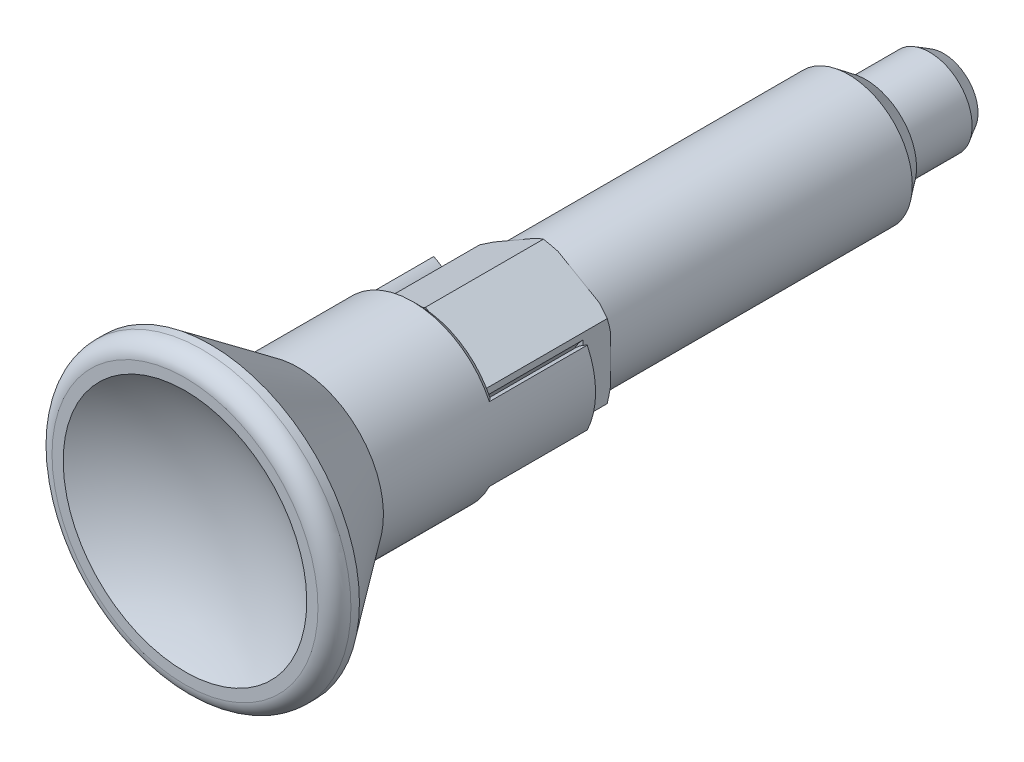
ISO-10303-21;
HEADER;
FILE_DESCRIPTION(('STEP AP214'),'2;1');
FILE_NAME('part.step','',(''),(''),'','','');
FILE_SCHEMA(('AUTOMOTIVE_DESIGN { 1 0 10303 214 1 1 1 1 }'));
ENDSEC;
DATA;
#1=APPLICATION_CONTEXT('core data for automotive mechanical design processes');
#2=APPLICATION_PROTOCOL_DEFINITION('international standard','automotive_design',2000,#1);
#3=PRODUCT_CONTEXT('',#1,'mechanical');
#4=PRODUCT('Part','Part','',(#3));
#5=PRODUCT_RELATED_PRODUCT_CATEGORY('part','',(#4));
#6=PRODUCT_DEFINITION_FORMATION('','',#4);
#7=PRODUCT_DEFINITION_CONTEXT('part definition',#1,'design');
#8=PRODUCT_DEFINITION('design','',#6,#7);
#9=PRODUCT_DEFINITION_SHAPE('','',#8);
#10=(LENGTH_UNIT() NAMED_UNIT(*) SI_UNIT(.MILLI.,.METRE.));
#11=(NAMED_UNIT(*) PLANE_ANGLE_UNIT() SI_UNIT($,.RADIAN.));
#12=(NAMED_UNIT(*) SI_UNIT($,.STERADIAN.) SOLID_ANGLE_UNIT());
#13=UNCERTAINTY_MEASURE_WITH_UNIT(LENGTH_MEASURE(1.E-05),#10,'distance_accuracy_value','');
#14=(GEOMETRIC_REPRESENTATION_CONTEXT(3) GLOBAL_UNCERTAINTY_ASSIGNED_CONTEXT((#13)) GLOBAL_UNIT_ASSIGNED_CONTEXT((#10,
#11,#12)) REPRESENTATION_CONTEXT('',''));
#15=CARTESIAN_POINT('',(0.,0.,0.));
#16=DIRECTION('',(0.,0.,1.));
#17=DIRECTION('',(1.,0.,0.));
#18=AXIS2_PLACEMENT_3D('',#15,#16,#17);
#19=CARTESIAN_POINT('',(3.,0.,0.));
#20=DIRECTION('',(0.,0.,-1.));
#21=DIRECTION('',(0.,1.,0.));
#22=AXIS2_PLACEMENT_3D('',#19,#20,#21);
#23=PLANE('',#22);
#24=CARTESIAN_POINT('',(0.,0.,3.69877739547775E-11));
#25=DIRECTION('',(0.,0.,1.));
#26=DIRECTION('',(0.,-1.,0.));
#27=AXIS2_PLACEMENT_3D('',#24,#25,#26);
#28=CIRCLE('',#27,3.1999999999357);
#29=CARTESIAN_POINT('',(2.46436507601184,2.04129977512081,5.38250000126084E-11));
#30=VERTEX_POINT('',#29);
#31=CARTESIAN_POINT('',(3.,1.11355287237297,3.53293783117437E-11));
#32=VERTEX_POINT('',#31);
#33=EDGE_CURVE('E225',#30,#32,#28,.F.);
#34=ORIENTED_EDGE('',*,*,#33,.T.);
#35=DIRECTION('',(0.,1.,0.));
#36=VECTOR('',#35,1.);
#37=CARTESIAN_POINT('',(3.,0.,0.));
#38=LINE('',#37,#36);
#39=CARTESIAN_POINT('',(3.,0.,0.));
#40=VERTEX_POINT('',#39);
#41=EDGE_CURVE('E231',#32,#40,#38,.F.);
#42=ORIENTED_EDGE('',*,*,#41,.T.);
#43=CARTESIAN_POINT('',(0.,0.,0.));
#44=DIRECTION('',(0.,0.,1.));
#45=DIRECTION('',(0.,-1.,0.));
#46=AXIS2_PLACEMENT_3D('',#43,#44,#45);
#47=CIRCLE('',#46,3.);
#48=CARTESIAN_POINT('',(1.5,2.59807621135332,0.));
#49=VERTEX_POINT('',#48);
#50=EDGE_CURVE('E1111',#49,#40,#47,.F.);
#51=ORIENTED_EDGE('',*,*,#50,.F.);
#52=DIRECTION('',(0.866025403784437,-0.5,0.));
#53=VECTOR('',#52,1.);
#54=CARTESIAN_POINT('',(1.5,2.59807621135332,0.));
#55=LINE('',#54,#53);
#56=EDGE_CURVE('E249',#49,#30,#55,.T.);
#57=ORIENTED_EDGE('',*,*,#56,.T.);
#58=EDGE_LOOP('',(#34,#42,#51,#57));
#59=FACE_BOUND('',#58,.T.);
#60=ADVANCED_FACE('F14',(#59),#23,.T.);
#61=CARTESIAN_POINT('',(3.,0.,0.));
#62=DIRECTION('',(0.,0.,-1.));
#63=DIRECTION('',(0.,1.,0.));
#64=AXIS2_PLACEMENT_3D('',#61,#62,#63);
#65=PLANE('',#64);
#66=CARTESIAN_POINT('',(0.,0.,3.69877739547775E-11));
#67=DIRECTION('',(0.,0.,1.));
#68=DIRECTION('',(0.,-1.,0.));
#69=AXIS2_PLACEMENT_3D('',#66,#67,#68);
#70=CIRCLE('',#69,3.1999999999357);
#71=CARTESIAN_POINT('',(3.,-1.11355287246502,5.38232652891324E-11));
#72=VERTEX_POINT('',#71);
#73=CARTESIAN_POINT('',(2.46436507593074,-2.04129977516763,3.50067197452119E-11));
#74=VERTEX_POINT('',#73);
#75=EDGE_CURVE('E255',#72,#74,#70,.F.);
#76=ORIENTED_EDGE('',*,*,#75,.T.);
#77=DIRECTION('',(-0.866025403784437,-0.5,0.));
#78=VECTOR('',#77,1.);
#79=CARTESIAN_POINT('',(2.4643650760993,-2.04129977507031,0.));
#80=LINE('',#79,#78);
#81=CARTESIAN_POINT('',(1.5,-2.59807621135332,0.));
#82=VERTEX_POINT('',#81);
#83=EDGE_CURVE('E1130',#74,#82,#80,.T.);
#84=ORIENTED_EDGE('',*,*,#83,.T.);
#85=CARTESIAN_POINT('',(0.,0.,0.));
#86=DIRECTION('',(0.,0.,1.));
#87=DIRECTION('',(0.,-1.,0.));
#88=AXIS2_PLACEMENT_3D('',#85,#86,#87);
#89=CIRCLE('',#88,3.);
#90=EDGE_CURVE('E1151',#40,#82,#89,.F.);
#91=ORIENTED_EDGE('',*,*,#90,.F.);
#92=DIRECTION('',(0.,1.,0.));
#93=VECTOR('',#92,1.);
#94=CARTESIAN_POINT('',(3.,0.,0.));
#95=LINE('',#94,#93);
#96=EDGE_CURVE('E237',#40,#72,#95,.F.);
#97=ORIENTED_EDGE('',*,*,#96,.T.);
#98=EDGE_LOOP('',(#76,#84,#91,#97));
#99=FACE_BOUND('',#98,.T.);
#100=ADVANCED_FACE('F824',(#99),#65,.T.);
#101=CARTESIAN_POINT('',(3.,0.,0.));
#102=DIRECTION('',(0.,0.,-1.));
#103=DIRECTION('',(0.,1.,0.));
#104=AXIS2_PLACEMENT_3D('',#101,#102,#103);
#105=PLANE('',#104);
#106=CARTESIAN_POINT('',(0.,0.,3.69877739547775E-11));
#107=DIRECTION('',(0.,0.,1.));
#108=DIRECTION('',(0.,-1.,0.));
#109=AXIS2_PLACEMENT_3D('',#106,#107,#108);
#110=CIRCLE('',#109,3.1999999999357);
#111=CARTESIAN_POINT('',(0.535634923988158,-3.15485264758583,5.38232652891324E-11));
#112=VERTEX_POINT('',#111);
#113=CARTESIAN_POINT('',(-0.53563492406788,-3.1548526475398,3.53311130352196E-11));
#114=VERTEX_POINT('',#113);
#115=EDGE_CURVE('E1126',#112,#114,#110,.F.);
#116=ORIENTED_EDGE('',*,*,#115,.T.);
#117=DIRECTION('',(-0.86602540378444,0.5,0.));
#118=VECTOR('',#117,1.);
#119=CARTESIAN_POINT('',(-0.535634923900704,-3.15485264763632,0.));
#120=LINE('',#119,#118);
#121=CARTESIAN_POINT('',(-1.5,-2.59807621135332,0.));
#122=VERTEX_POINT('',#121);
#123=EDGE_CURVE('E1123',#114,#122,#120,.T.);
#124=ORIENTED_EDGE('',*,*,#123,.T.);
#125=CARTESIAN_POINT('',(0.,0.,0.));
#126=DIRECTION('',(0.,0.,1.));
#127=DIRECTION('',(0.,-1.,0.));
#128=AXIS2_PLACEMENT_3D('',#125,#126,#127);
#129=CIRCLE('',#128,3.);
#130=EDGE_CURVE('E1146',#82,#122,#129,.F.);
#131=ORIENTED_EDGE('',*,*,#130,.F.);
#132=DIRECTION('',(-0.86602540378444,-0.5,0.));
#133=VECTOR('',#132,1.);
#134=CARTESIAN_POINT('',(1.5,-2.59807621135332,0.));
#135=LINE('',#134,#133);
#136=EDGE_CURVE('E1127',#82,#112,#135,.T.);
#137=ORIENTED_EDGE('',*,*,#136,.T.);
#138=EDGE_LOOP('',(#116,#124,#131,#137));
#139=FACE_BOUND('',#138,.T.);
#140=ADVANCED_FACE('F814',(#139),#105,.T.);
#141=CARTESIAN_POINT('',(3.,0.,0.));
#142=DIRECTION('',(0.,0.,-1.));
#143=DIRECTION('',(0.,1.,0.));
#144=AXIS2_PLACEMENT_3D('',#141,#142,#143);
#145=PLANE('',#144);
#146=CARTESIAN_POINT('',(0.,0.,0.));
#147=DIRECTION('',(0.,0.,1.));
#148=DIRECTION('',(0.,-1.,0.));
#149=AXIS2_PLACEMENT_3D('',#146,#147,#148);
#150=CIRCLE('',#149,3.);
#151=CARTESIAN_POINT('',(-3.,0.,0.));
#152=VERTEX_POINT('',#151);
#153=EDGE_CURVE('E1150',#122,#152,#150,.F.);
#154=ORIENTED_EDGE('',*,*,#153,.F.);
#155=DIRECTION('',(-0.866025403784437,0.5,0.));
#156=VECTOR('',#155,1.);
#157=CARTESIAN_POINT('',(-1.5,-2.59807621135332,0.));
#158=LINE('',#157,#156);
#159=CARTESIAN_POINT('',(-2.46436507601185,-2.04129977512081,5.38250000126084E-11));
#160=VERTEX_POINT('',#159);
#161=EDGE_CURVE('E1116',#122,#160,#158,.T.);
#162=ORIENTED_EDGE('',*,*,#161,.T.);
#163=CARTESIAN_POINT('',(0.,0.,3.69877739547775E-11));
#164=DIRECTION('',(0.,0.,1.));
#165=DIRECTION('',(0.,-1.,0.));
#166=AXIS2_PLACEMENT_3D('',#163,#164,#165);
#167=CIRCLE('',#166,3.1999999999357);
#168=CARTESIAN_POINT('',(-3.,-1.11355287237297,3.53293783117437E-11));
#169=VERTEX_POINT('',#168);
#170=EDGE_CURVE('E1122',#160,#169,#167,.F.);
#171=ORIENTED_EDGE('',*,*,#170,.T.);
#172=DIRECTION('',(0.,1.,0.));
#173=VECTOR('',#172,1.);
#174=CARTESIAN_POINT('',(-3.,0.,0.));
#175=LINE('',#174,#173);
#176=EDGE_CURVE('E1119',#169,#152,#175,.T.);
#177=ORIENTED_EDGE('',*,*,#176,.T.);
#178=EDGE_LOOP('',(#154,#162,#171,#177));
#179=FACE_BOUND('',#178,.T.);
#180=ADVANCED_FACE('F804',(#179),#145,.T.);
#181=CARTESIAN_POINT('',(3.,0.,0.));
#182=DIRECTION('',(0.,0.,-1.));
#183=DIRECTION('',(0.,1.,0.));
#184=AXIS2_PLACEMENT_3D('',#181,#182,#183);
#185=PLANE('',#184);
#186=CARTESIAN_POINT('',(0.,0.,3.69877739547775E-11));
#187=DIRECTION('',(0.,0.,1.));
#188=DIRECTION('',(0.,-1.,0.));
#189=AXIS2_PLACEMENT_3D('',#186,#187,#188);
#190=CIRCLE('',#189,3.1999999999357);
#191=CARTESIAN_POINT('',(-3.,1.11355287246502,5.38232652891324E-11));
#192=VERTEX_POINT('',#191);
#193=CARTESIAN_POINT('',(-2.46436507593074,2.04129977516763,3.50067197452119E-11));
#194=VERTEX_POINT('',#193);
#195=EDGE_CURVE('E1112',#192,#194,#190,.F.);
#196=ORIENTED_EDGE('',*,*,#195,.T.);
#197=DIRECTION('',(0.866025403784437,0.5,0.));
#198=VECTOR('',#197,1.);
#199=CARTESIAN_POINT('',(-2.4643650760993,2.04129977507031,0.));
#200=LINE('',#199,#198);
#201=CARTESIAN_POINT('',(-1.5,2.59807621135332,0.));
#202=VERTEX_POINT('',#201);
#203=EDGE_CURVE('E1109',#194,#202,#200,.T.);
#204=ORIENTED_EDGE('',*,*,#203,.T.);
#205=CARTESIAN_POINT('',(0.,0.,0.));
#206=DIRECTION('',(0.,0.,1.));
#207=DIRECTION('',(0.,-1.,0.));
#208=AXIS2_PLACEMENT_3D('',#205,#206,#207);
#209=CIRCLE('',#208,3.);
#210=EDGE_CURVE('E1243',#152,#202,#209,.F.);
#211=ORIENTED_EDGE('',*,*,#210,.F.);
#212=DIRECTION('',(0.,1.,0.));
#213=VECTOR('',#212,1.);
#214=CARTESIAN_POINT('',(-3.,0.,0.));
#215=LINE('',#214,#213);
#216=EDGE_CURVE('E1113',#152,#192,#215,.T.);
#217=ORIENTED_EDGE('',*,*,#216,.T.);
#218=EDGE_LOOP('',(#196,#204,#211,#217));
#219=FACE_BOUND('',#218,.T.);
#220=ADVANCED_FACE('F794',(#219),#185,.T.);
#221=CARTESIAN_POINT('',(0.,0.,-15.));
#222=DIRECTION('',(0.,0.,1.));
#223=DIRECTION('',(0.,-1.,0.));
#224=AXIS2_PLACEMENT_3D('',#221,#222,#223);
#225=CYLINDRICAL_SURFACE('',#224,3.);
#226=ORIENTED_EDGE('',*,*,#210,.T.);
#227=CARTESIAN_POINT('',(0.,0.,0.));
#228=DIRECTION('',(0.,0.,1.));
#229=DIRECTION('',(0.,-1.,0.));
#230=AXIS2_PLACEMENT_3D('',#227,#228,#229);
#231=CIRCLE('',#230,3.);
#232=EDGE_CURVE('E1106',#49,#202,#231,.T.);
#233=ORIENTED_EDGE('',*,*,#232,.F.);
#234=ORIENTED_EDGE('',*,*,#50,.T.);
#235=ORIENTED_EDGE('',*,*,#90,.T.);
#236=ORIENTED_EDGE('',*,*,#130,.T.);
#237=ORIENTED_EDGE('',*,*,#153,.T.);
#238=EDGE_LOOP('',(#226,#233,#234,#235,#236,#237));
#239=FACE_BOUND('',#238,.T.);
#240=CARTESIAN_POINT('',(0.,0.,-14.1865));
#241=DIRECTION('',(0.,0.,1.));
#242=DIRECTION('',(0.,-1.,0.));
#243=AXIS2_PLACEMENT_3D('',#240,#241,#242);
#244=CIRCLE('',#243,3.);
#245=CARTESIAN_POINT('',(0.,-3.,-14.1865));
#246=VERTEX_POINT('',#245);
#247=EDGE_CURVE('E251',#246,#246,#244,.T.);
#248=ORIENTED_EDGE('',*,*,#247,.T.);
#249=EDGE_LOOP('',(#248));
#250=FACE_BOUND('',#249,.T.);
#251=ADVANCED_FACE('F784',(#239,#250),#225,.T.);
#252=CARTESIAN_POINT('',(3.,0.,0.));
#253=DIRECTION('',(0.,0.,-1.));
#254=DIRECTION('',(0.,1.,0.));
#255=AXIS2_PLACEMENT_3D('',#252,#253,#254);
#256=PLANE('',#255);
#257=CARTESIAN_POINT('',(0.,0.,3.69886413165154E-11));
#258=DIRECTION('',(0.,0.,1.));
#259=DIRECTION('',(0.,-1.,0.));
#260=AXIS2_PLACEMENT_3D('',#257,#258,#259);
#261=CIRCLE('',#260,3.1999999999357);
#262=CARTESIAN_POINT('',(0.535634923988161,3.15485264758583,5.38250000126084E-11));
#263=VERTEX_POINT('',#262);
#264=CARTESIAN_POINT('',(-0.535634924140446,3.1548526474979,1.84938869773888E-11));
#265=VERTEX_POINT('',#264);
#266=EDGE_CURVE('E1105',#263,#265,#261,.T.);
#267=ORIENTED_EDGE('',*,*,#266,.F.);
#268=DIRECTION('',(-0.866025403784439,0.5,0.));
#269=VECTOR('',#268,1.);
#270=CARTESIAN_POINT('',(3.,1.73205080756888,0.));
#271=LINE('',#270,#269);
#272=EDGE_CURVE('E1088',#49,#263,#271,.T.);
#273=ORIENTED_EDGE('',*,*,#272,.F.);
#274=ORIENTED_EDGE('',*,*,#232,.T.);
#275=DIRECTION('',(0.86602540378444,0.5,0.));
#276=VECTOR('',#275,1.);
#277=CARTESIAN_POINT('',(-1.5,2.59807621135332,0.));
#278=LINE('',#277,#276);
#279=EDGE_CURVE('E1103',#202,#265,#278,.T.);
#280=ORIENTED_EDGE('',*,*,#279,.T.);
#281=EDGE_LOOP('',(#267,#273,#274,#280));
#282=FACE_BOUND('',#281,.T.);
#283=ADVANCED_FACE('F774',(#282),#256,.T.);
#284=CARTESIAN_POINT('',(0.,0.,0.153394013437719));
#285=DIRECTION('',(0.,0.,1.));
#286=DIRECTION('',(0.,-1.,0.));
#287=AXIS2_PLACEMENT_3D('',#284,#285,#286);
#288=CONICAL_SURFACE('',#287,3.46568622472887,1.04719755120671);
#289=CARTESIAN_POINT('',(-2.08279215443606E-11,3.46410161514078,0.152479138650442));
#290=CARTESIAN_POINT('',(-0.0441893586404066,3.43858887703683,0.137749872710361));
#291=CARTESIAN_POINT('',(-0.0884924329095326,3.41301048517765,0.123469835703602));
#292=CARTESIAN_POINT('',(-0.177307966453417,3.36173281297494,0.0958975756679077));
#293=CARTESIAN_POINT('',(-0.221820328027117,3.33603358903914,0.0826049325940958));
#294=CARTESIAN_POINT('',(-0.311076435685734,3.28450155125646,0.0570834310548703));
#295=CARTESIAN_POINT('',(-0.35582019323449,3.25866873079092,0.0448546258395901));
#296=CARTESIAN_POINT('',(-0.445551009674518,3.20686261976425,0.021543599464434));
#297=CARTESIAN_POINT('',(-0.490538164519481,3.18088927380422,0.0104618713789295));
#298=CARTESIAN_POINT('',(-0.535634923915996,3.15485264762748,7.04766106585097E-11));
#299=B_SPLINE_CURVE_WITH_KNOTS('',3,(#289,#290,#291,#292,#293,#294,#295,#296,#297,#298),
.UNSPECIFIED.,.F.,.F.,(4,2,2,2,4),(0.,0.159326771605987,0.31858537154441,0.477851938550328,
0.63718668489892),.UNSPECIFIED.);
#300=CARTESIAN_POINT('',(0.,3.46410161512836,0.152479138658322));
#301=VERTEX_POINT('',#300);
#302=EDGE_CURVE('E893',#301,#265,#299,.T.);
#303=ORIENTED_EDGE('',*,*,#302,.F.);
#304=CARTESIAN_POINT('',(0.535634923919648,3.15485264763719,6.46357967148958E-11));
#305=CARTESIAN_POINT('',(0.490538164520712,3.1808892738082,0.0104618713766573));
#306=CARTESIAN_POINT('',(0.445551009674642,3.20686261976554,0.0215435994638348));
#307=CARTESIAN_POINT('',(0.355820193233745,3.25866873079,0.044854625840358));
#308=CARTESIAN_POINT('',(0.311076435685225,3.28450155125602,0.057083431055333));
#309=CARTESIAN_POINT('',(0.221820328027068,3.33603358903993,0.0826049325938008));
#310=CARTESIAN_POINT('',(0.177307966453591,3.36173281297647,0.0958975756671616));
#311=CARTESIAN_POINT('',(0.0884924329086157,3.41301048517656,0.123469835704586));
#312=CARTESIAN_POINT('',(0.0441893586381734,3.43858887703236,0.137749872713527));
#313=CARTESIAN_POINT('',(1.57163105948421E-11,3.46410161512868,0.152479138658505));
#314=B_SPLINE_CURVE_WITH_KNOTS('',3,(#304,#305,#306,#307,#308,#309,#310,#311,#312,#313),
.UNSPECIFIED.,.F.,.F.,(4,2,2,2,4),(0.,0.159334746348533,0.318601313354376,0.477859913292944,
0.637186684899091),.UNSPECIFIED.);
#315=EDGE_CURVE('E886',#263,#301,#314,.T.);
#316=ORIENTED_EDGE('',*,*,#315,.F.);
#317=ORIENTED_EDGE('',*,*,#266,.T.);
#318=EDGE_LOOP('',(#303,#316,#317));
#319=FACE_BOUND('',#318,.T.);
#320=ADVANCED_FACE('F554',(#319),#288,.T.);
#321=CARTESIAN_POINT('',(0.,0.,0.153394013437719));
#322=DIRECTION('',(0.,0.,1.));
#323=DIRECTION('',(0.,-1.,0.));
#324=AXIS2_PLACEMENT_3D('',#321,#322,#323);
#325=CONICAL_SURFACE('',#324,3.46568622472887,1.04719755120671);
#326=CARTESIAN_POINT('',(2.08275457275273E-11,-3.46410161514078,0.152479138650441));
#327=CARTESIAN_POINT('',(0.0441893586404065,-3.43858887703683,0.137749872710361));
#328=CARTESIAN_POINT('',(0.0884924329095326,-3.41301048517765,0.123469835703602));
#329=CARTESIAN_POINT('',(0.177307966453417,-3.36173281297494,0.0958975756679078));
#330=CARTESIAN_POINT('',(0.221820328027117,-3.33603358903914,0.0826049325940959));
#331=CARTESIAN_POINT('',(0.311076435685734,-3.28450155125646,0.0570834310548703));
#332=CARTESIAN_POINT('',(0.35582019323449,-3.25866873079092,0.0448546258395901));
#333=CARTESIAN_POINT('',(0.445551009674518,-3.20686261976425,0.021543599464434));
#334=CARTESIAN_POINT('',(0.490538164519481,-3.18088927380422,0.0104618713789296));
#335=CARTESIAN_POINT('',(0.535634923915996,-3.15485264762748,7.04766106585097E-11));
#336=B_SPLINE_CURVE_WITH_KNOTS('',3,(#326,#327,#328,#329,#330,#331,#332,#333,#334,#335),
.UNSPECIFIED.,.F.,.F.,(4,2,2,2,4),(0.,0.159326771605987,0.31858537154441,0.477851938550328,
0.63718668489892),.UNSPECIFIED.);
#337=CARTESIAN_POINT('',(8.13771874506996E-12,-3.46410161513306,0.152479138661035));
#338=VERTEX_POINT('',#337);
#339=EDGE_CURVE('E1031',#338,#112,#336,.T.);
#340=ORIENTED_EDGE('',*,*,#339,.F.);
#341=CARTESIAN_POINT('',(-0.535634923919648,-3.15485264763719,6.46357967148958E-11));
#342=CARTESIAN_POINT('',(-0.490538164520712,-3.1808892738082,0.0104618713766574));
#343=CARTESIAN_POINT('',(-0.445551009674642,-3.20686261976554,0.021543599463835));
#344=CARTESIAN_POINT('',(-0.355820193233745,-3.25866873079,0.0448546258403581));
#345=CARTESIAN_POINT('',(-0.311076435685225,-3.28450155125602,0.057083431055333));
#346=CARTESIAN_POINT('',(-0.221820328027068,-3.33603358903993,0.0826049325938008));
#347=CARTESIAN_POINT('',(-0.177307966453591,-3.36173281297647,0.0958975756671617));
#348=CARTESIAN_POINT('',(-0.0884924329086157,-3.41301048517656,0.123469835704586));
#349=CARTESIAN_POINT('',(-0.0441893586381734,-3.43858887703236,0.137749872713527));
#350=CARTESIAN_POINT('',(-1.57160929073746E-11,-3.46410161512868,0.152479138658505));
#351=B_SPLINE_CURVE_WITH_KNOTS('',3,(#341,#342,#343,#344,#345,#346,#347,#348,#349,#350),
.UNSPECIFIED.,.F.,.F.,(4,2,2,2,4),(0.,0.159334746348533,0.318601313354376,0.477859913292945,
0.637186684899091),.UNSPECIFIED.);
#352=EDGE_CURVE('E999',#114,#338,#351,.T.);
#353=ORIENTED_EDGE('',*,*,#352,.F.);
#354=ORIENTED_EDGE('',*,*,#115,.F.);
#355=EDGE_LOOP('',(#340,#353,#354));
#356=FACE_BOUND('',#355,.T.);
#357=ADVANCED_FACE('F548',(#356),#325,.T.);
#358=CARTESIAN_POINT('',(0.,-3.46410161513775,0.));
#359=DIRECTION('',(0.5,-0.866025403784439,0.));
#360=DIRECTION('',(0.866025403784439,0.5,0.));
#361=AXIS2_PLACEMENT_3D('',#358,#359,#360);
#362=PLANE('',#361);
#363=CARTESIAN_POINT('',(3.,-1.73205080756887,5.87684739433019));
#364=CARTESIAN_POINT('',(2.95566248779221,-1.75764908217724,5.88878376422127));
#365=CARTESIAN_POINT('',(2.91124823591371,-1.78329166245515,5.90034446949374));
#366=CARTESIAN_POINT('',(2.82227960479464,-1.83465772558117,5.9226477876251));
#367=CARTESIAN_POINT('',(2.77772527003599,-1.86038118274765,5.93339063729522));
#368=CARTESIAN_POINT('',(2.6884625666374,-1.91191702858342,5.95399883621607));
#369=CARTESIAN_POINT('',(2.64375419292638,-1.9377294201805,5.96386415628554));
#370=CARTESIAN_POINT('',(2.55417624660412,-1.98944727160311,5.98265459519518));
#371=CARTESIAN_POINT('',(2.50930663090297,-2.01535275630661,5.99157943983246));
#372=CARTESIAN_POINT('',(2.4643650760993,-2.04129977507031,6.));
#373=B_SPLINE_CURVE_WITH_KNOTS('',3,(#363,#364,#365,#366,#367,#368,#369,#370,#371,#372),
.UNSPECIFIED.,.F.,.F.,(4,2,2,2,4),(0.,0.157708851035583,0.315371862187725,0.473040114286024,
0.63075420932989),.UNSPECIFIED.);
#374=CARTESIAN_POINT('',(3.,-1.73205080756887,5.87684739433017));
#375=VERTEX_POINT('',#374);
#376=CARTESIAN_POINT('',(2.46436507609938,-2.04129977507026,6.));
#377=VERTEX_POINT('',#376);
#378=EDGE_CURVE('E1024',#375,#377,#373,.T.);
#379=ORIENTED_EDGE('',*,*,#378,.T.);
#380=DIRECTION('',(0.866025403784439,0.5,0.));
#381=VECTOR('',#380,1.);
#382=CARTESIAN_POINT('',(0.,-3.46410161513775,6.));
#383=LINE('',#382,#381);
#384=CARTESIAN_POINT('',(1.17819066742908,-2.78387291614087,6.));
#385=VERTEX_POINT('',#384);
#386=EDGE_CURVE('E1018',#377,#385,#383,.F.);
#387=ORIENTED_EDGE('',*,*,#386,.T.);
#388=DIRECTION('',(0.,0.,1.));
#389=VECTOR('',#388,1.);
#390=CARTESIAN_POINT('',(1.17819066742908,-2.78387291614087,0.));
#391=LINE('',#390,#389);
#392=CARTESIAN_POINT('',(1.17819066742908,-2.78387291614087,5.7));
#393=VERTEX_POINT('',#392);
#394=EDGE_CURVE('E1102',#385,#393,#391,.F.);
#395=ORIENTED_EDGE('',*,*,#394,.T.);
#396=DIRECTION('',(0.866025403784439,0.5,0.));
#397=VECTOR('',#396,1.);
#398=CARTESIAN_POINT('',(0.,-3.46410161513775,5.7));
#399=LINE('',#398,#397);
#400=CARTESIAN_POINT('',(0.,-3.46410161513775,5.7));
#401=VERTEX_POINT('',#400);
#402=EDGE_CURVE('E1099',#393,#401,#399,.F.);
#403=ORIENTED_EDGE('',*,*,#402,.T.);
#404=DIRECTION('',(0.,0.,1.));
#405=VECTOR('',#404,1.);
#406=CARTESIAN_POINT('',(0.,-3.46410161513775,0.));
#407=LINE('',#406,#405);
#408=EDGE_CURVE('E1076',#338,#401,#407,.T.);
#409=ORIENTED_EDGE('',*,*,#408,.F.);
#410=ORIENTED_EDGE('',*,*,#339,.T.);
#411=ORIENTED_EDGE('',*,*,#136,.F.);
#412=ORIENTED_EDGE('',*,*,#83,.F.);
#413=CARTESIAN_POINT('',(2.99999999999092,-1.73205080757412,0.152479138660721));
#414=CARTESIAN_POINT('',(2.95581064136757,-1.75756354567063,0.137749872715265));
#415=CARTESIAN_POINT('',(2.9115075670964,-1.78314193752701,0.123469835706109));
#416=CARTESIAN_POINT('',(2.82269203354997,-1.83441960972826,0.0958975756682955));
#417=CARTESIAN_POINT('',(2.77817967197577,-1.86011883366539,0.08260493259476));
#418=CARTESIAN_POINT('',(2.68892356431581,-1.91165087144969,0.0570834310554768));
#419=CARTESIAN_POINT('',(2.6441798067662,-1.93748369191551,0.0448546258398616));
#420=CARTESIAN_POINT('',(2.55444899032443,-1.98928980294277,0.0215435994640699));
#421=CARTESIAN_POINT('',(2.50946183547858,-2.0152631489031,0.0104618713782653));
#422=CARTESIAN_POINT('',(2.46436507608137,-2.04129977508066,6.98651206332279E-11));
#423=B_SPLINE_CURVE_WITH_KNOTS('',3,(#413,#414,#415,#416,#417,#418,#419,#420,#421,#422),
.UNSPECIFIED.,.F.,.F.,(4,2,2,2,4),(0.,0.159326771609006,0.318585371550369,0.477851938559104,
0.637186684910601),.UNSPECIFIED.);
#424=CARTESIAN_POINT('',(2.99999999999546,-1.73205080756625,0.152479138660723));
#425=VERTEX_POINT('',#424);
#426=EDGE_CURVE('E1009',#425,#74,#423,.T.);
#427=ORIENTED_EDGE('',*,*,#426,.F.);
#428=DIRECTION('',(0.,0.,1.));
#429=VECTOR('',#428,1.);
#430=CARTESIAN_POINT('',(3.,-1.73205080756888,0.));
#431=LINE('',#430,#429);
#432=EDGE_CURVE('E978',#375,#425,#431,.F.);
#433=ORIENTED_EDGE('',*,*,#432,.F.);
#434=EDGE_LOOP('',(#379,#387,#395,#403,#409,#410,#411,#412,#427,#433));
#435=FACE_BOUND('',#434,.T.);
#436=ADVANCED_FACE('F553',(#435),#362,.T.);
#437=CARTESIAN_POINT('',(0.,0.,0.153394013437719));
#438=DIRECTION('',(0.,0.,1.));
#439=DIRECTION('',(0.,-1.,0.));
#440=AXIS2_PLACEMENT_3D('',#437,#438,#439);
#441=CONICAL_SURFACE('',#440,3.46568622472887,1.04719755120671);
#442=CARTESIAN_POINT('',(3.,-1.73205080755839,0.152479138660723));
#443=CARTESIAN_POINT('',(3.,-1.68102533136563,0.137749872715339));
#444=CARTESIAN_POINT('',(3.,-1.6298685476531,0.12346983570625));
#445=CARTESIAN_POINT('',(3.,-1.5273132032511,0.095897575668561));
#446=CARTESIAN_POINT('',(3.,-1.47591475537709,0.0826049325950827));
#447=CARTESIAN_POINT('',(3.,-1.372850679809,0.0570834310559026));
#448=CARTESIAN_POINT('',(3.,-1.32118503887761,0.0448546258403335));
#449=CARTESIAN_POINT('',(3.,-1.2175728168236,0.0215435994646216));
#450=CARTESIAN_POINT('',(3.,-1.1656261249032,0.0104618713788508));
#451=CARTESIAN_POINT('',(3.,-1.11355287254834,7.04774780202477E-11));
#452=B_SPLINE_CURVE_WITH_KNOTS('',3,(#442,#443,#444,#445,#446,#447,#448,#449,#450,#451),
.UNSPECIFIED.,.F.,.F.,(4,2,2,2,4),(0.,0.159326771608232,0.318585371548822,0.477851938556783,
0.637186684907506),.UNSPECIFIED.);
#453=EDGE_CURVE('E246',#425,#72,#452,.T.);
#454=ORIENTED_EDGE('',*,*,#453,.F.);
#455=ORIENTED_EDGE('',*,*,#426,.T.);
#456=ORIENTED_EDGE('',*,*,#75,.F.);
#457=EDGE_LOOP('',(#454,#455,#456));
#458=FACE_BOUND('',#457,.T.);
#459=ADVANCED_FACE('F566',(#458),#441,.T.);
#460=CARTESIAN_POINT('',(0.,0.,0.153394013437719));
#461=DIRECTION('',(0.,0.,1.));
#462=DIRECTION('',(0.,-1.,0.));
#463=AXIS2_PLACEMENT_3D('',#460,#461,#462);
#464=CONICAL_SURFACE('',#463,3.46568622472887,1.04719755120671);
#465=CARTESIAN_POINT('',(2.99999999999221,1.73205080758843,0.152479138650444));
#466=CARTESIAN_POINT('',(2.9558106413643,1.75756354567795,0.137749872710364));
#467=CARTESIAN_POINT('',(2.91150756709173,1.78314193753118,0.123469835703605));
#468=CARTESIAN_POINT('',(2.82269203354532,1.83441960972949,0.0958975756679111));
#469=CARTESIAN_POINT('',(2.77817967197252,1.86011883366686,0.0826049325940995));
#470=CARTESIAN_POINT('',(2.68892356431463,1.9116508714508,0.0570834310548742));
#471=CARTESIAN_POINT('',(2.64417980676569,1.93748369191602,0.0448546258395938));
#472=CARTESIAN_POINT('',(2.5544489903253,1.98928980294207,0.0215435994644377));
#473=CARTESIAN_POINT('',(2.50946183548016,2.01526314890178,0.0104618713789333));
#474=CARTESIAN_POINT('',(2.46436507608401,2.04129977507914,7.04809474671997E-11));
#475=B_SPLINE_CURVE_WITH_KNOTS('',3,(#465,#466,#467,#468,#469,#470,#471,#472,#473,#474),
.UNSPECIFIED.,.F.,.F.,(4,2,2,2,4),(0.,0.159326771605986,0.318585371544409,0.477851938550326,
0.637186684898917),.UNSPECIFIED.);
#476=CARTESIAN_POINT('',(2.99999999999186,1.73205080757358,0.152479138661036));
#477=VERTEX_POINT('',#476);
#478=EDGE_CURVE('E243',#477,#30,#475,.T.);
#479=ORIENTED_EDGE('',*,*,#478,.F.);
#480=CARTESIAN_POINT('',(3.00000000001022,1.11355287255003,6.46349293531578E-11));
#481=CARTESIAN_POINT('',(3.00000000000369,1.16562612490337,0.0104618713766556));
#482=CARTESIAN_POINT('',(3.00000000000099,1.21757281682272,0.0215435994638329));
#483=CARTESIAN_POINT('',(2.99999999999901,1.32118503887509,0.0448546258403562));
#484=CARTESIAN_POINT('',(2.99999999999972,1.37285067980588,0.0570834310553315));
#485=CARTESIAN_POINT('',(3.00000000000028,1.47591475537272,0.0826049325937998));
#486=CARTESIAN_POINT('',(3.00000000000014,1.52731320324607,0.0958975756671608));
#487=CARTESIAN_POINT('',(2.99999999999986,1.62986854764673,0.123469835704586));
#488=CARTESIAN_POINT('',(2.99999999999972,1.68102533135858,0.137749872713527));
#489=CARTESIAN_POINT('',(3.,1.73205080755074,0.152479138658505));
#490=B_SPLINE_CURVE_WITH_KNOTS('',3,(#480,#481,#482,#483,#484,#485,#486,#487,#488,#489),
.UNSPECIFIED.,.F.,.F.,(4,2,2,2,4),(0.,0.159334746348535,0.318601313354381,0.477859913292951,
0.6371866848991),.UNSPECIFIED.);
#491=EDGE_CURVE('E234',#32,#477,#490,.T.);
#492=ORIENTED_EDGE('',*,*,#491,.F.);
#493=ORIENTED_EDGE('',*,*,#33,.F.);
#494=EDGE_LOOP('',(#479,#492,#493));
#495=FACE_BOUND('',#494,.T.);
#496=ADVANCED_FACE('F242',(#495),#464,.T.);
#497=CARTESIAN_POINT('',(3.,1.73205080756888,0.));
#498=DIRECTION('',(0.5,0.866025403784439,0.));
#499=DIRECTION('',(-0.866025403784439,0.5,0.));
#500=AXIS2_PLACEMENT_3D('',#497,#498,#499);
#501=PLANE('',#500);
#502=DIRECTION('',(0.,0.,1.));
#503=VECTOR('',#502,1.);
#504=CARTESIAN_POINT('',(0.,3.46410161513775,0.));
#505=LINE('',#504,#503);
#506=CARTESIAN_POINT('',(0.,3.46410161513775,5.7));
#507=VERTEX_POINT('',#506);
#508=EDGE_CURVE('E901',#507,#301,#505,.F.);
#509=ORIENTED_EDGE('',*,*,#508,.F.);
#510=DIRECTION('',(-0.86602540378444,0.5,0.));
#511=VECTOR('',#510,1.);
#512=CARTESIAN_POINT('',(1.17819066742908,2.78387291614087,5.7));
#513=LINE('',#512,#511);
#514=CARTESIAN_POINT('',(1.17819066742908,2.78387291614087,5.7));
#515=VERTEX_POINT('',#514);
#516=EDGE_CURVE('E1073',#515,#507,#513,.T.);
#517=ORIENTED_EDGE('',*,*,#516,.F.);
#518=DIRECTION('',(0.,0.,1.));
#519=VECTOR('',#518,1.);
#520=CARTESIAN_POINT('',(1.17819066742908,2.78387291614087,0.));
#521=LINE('',#520,#519);
#522=CARTESIAN_POINT('',(1.17819066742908,2.78387291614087,6.));
#523=VERTEX_POINT('',#522);
#524=EDGE_CURVE('E1017',#515,#523,#521,.T.);
#525=ORIENTED_EDGE('',*,*,#524,.T.);
#526=DIRECTION('',(-0.866025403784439,0.5,0.));
#527=VECTOR('',#526,1.);
#528=CARTESIAN_POINT('',(3.,1.73205080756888,6.));
#529=LINE('',#528,#527);
#530=CARTESIAN_POINT('',(2.4643650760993,2.04129977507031,6.));
#531=VERTEX_POINT('',#530);
#532=EDGE_CURVE('E1091',#523,#531,#529,.F.);
#533=ORIENTED_EDGE('',*,*,#532,.T.);
#534=CARTESIAN_POINT('',(2.4643650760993,2.04129977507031,6.));
#535=CARTESIAN_POINT('',(2.50930663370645,2.01535275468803,5.9915794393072));
#536=CARTESIAN_POINT('',(2.55417625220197,1.9894472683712,5.98265459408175));
#537=CARTESIAN_POINT('',(2.64375420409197,1.93772941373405,5.96386415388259));
#538=CARTESIAN_POINT('',(2.68846258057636,1.91191702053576,5.95399883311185));
#539=CARTESIAN_POINT('',(2.77772528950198,1.86038117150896,5.93339063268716));
#540=CARTESIAN_POINT('',(2.82227962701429,1.83465771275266,5.92264778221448));
#541=CARTESIAN_POINT('',(2.91124826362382,1.78329164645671,5.90034446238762));
#542=CARTESIAN_POINT('',(2.95566251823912,1.75764906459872,5.88878375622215));
#543=CARTESIAN_POINT('',(3.00000003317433,1.73205078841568,5.8768473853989));
#544=B_SPLINE_CURVE_WITH_KNOTS('',3,(#534,#535,#536,#537,#538,#539,#540,#541,#542,#543),
.UNSPECIFIED.,.F.,.F.,(4,2,2,2,4),(0.,0.157714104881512,0.31538236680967,0.473045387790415,
0.630754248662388),.UNSPECIFIED.);
#545=CARTESIAN_POINT('',(3.00000001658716,1.73205079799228,5.87684738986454));
#546=VERTEX_POINT('',#545);
#547=EDGE_CURVE('E1019',#531,#546,#544,.T.);
#548=ORIENTED_EDGE('',*,*,#547,.T.);
#549=DIRECTION('',(0.,0.,1.));
#550=VECTOR('',#549,1.);
#551=CARTESIAN_POINT('',(3.,1.73205080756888,0.));
#552=LINE('',#551,#550);
#553=EDGE_CURVE('E245',#477,#546,#552,.T.);
#554=ORIENTED_EDGE('',*,*,#553,.F.);
#555=ORIENTED_EDGE('',*,*,#478,.T.);
#556=ORIENTED_EDGE('',*,*,#56,.F.);
#557=ORIENTED_EDGE('',*,*,#272,.T.);
#558=ORIENTED_EDGE('',*,*,#315,.T.);
#559=EDGE_LOOP('',(#509,#517,#525,#533,#548,#554,#555,#556,#557,#558));
#560=FACE_BOUND('',#559,.T.);
#561=ADVANCED_FACE('F578',(#560),#501,.T.);
#562=CARTESIAN_POINT('',(0.,3.46410161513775,0.));
#563=DIRECTION('',(-0.5,0.866025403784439,0.));
#564=DIRECTION('',(-0.866025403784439,-0.5,0.));
#565=AXIS2_PLACEMENT_3D('',#562,#563,#564);
#566=PLANE('',#565);
#567=CARTESIAN_POINT('',(-3.,1.73205080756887,5.87684739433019));
#568=CARTESIAN_POINT('',(-2.95566248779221,1.75764908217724,5.88878376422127));
#569=CARTESIAN_POINT('',(-2.91124823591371,1.78329166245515,5.90034446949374));
#570=CARTESIAN_POINT('',(-2.82227960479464,1.83465772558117,5.9226477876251));
#571=CARTESIAN_POINT('',(-2.77772527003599,1.86038118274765,5.93339063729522));
#572=CARTESIAN_POINT('',(-2.6884625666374,1.91191702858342,5.95399883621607));
#573=CARTESIAN_POINT('',(-2.64375419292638,1.9377294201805,5.96386415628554));
#574=CARTESIAN_POINT('',(-2.55417624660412,1.98944727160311,5.98265459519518));
#575=CARTESIAN_POINT('',(-2.50930663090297,2.01535275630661,5.99157943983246));
#576=CARTESIAN_POINT('',(-2.4643650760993,2.04129977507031,6.));
#577=B_SPLINE_CURVE_WITH_KNOTS('',3,(#567,#568,#569,#570,#571,#572,#573,#574,#575,#576),
.UNSPECIFIED.,.F.,.F.,(4,2,2,2,4),(0.,0.157708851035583,0.315371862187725,0.473040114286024,
0.63075420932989),.UNSPECIFIED.);
#578=CARTESIAN_POINT('',(-3.,1.73205080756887,5.87684739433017));
#579=VERTEX_POINT('',#578);
#580=CARTESIAN_POINT('',(-2.46436507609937,2.04129977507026,6.));
#581=VERTEX_POINT('',#580);
#582=EDGE_CURVE('E900',#579,#581,#577,.T.);
#583=ORIENTED_EDGE('',*,*,#582,.T.);
#584=DIRECTION('',(-0.866025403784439,-0.5,0.));
#585=VECTOR('',#584,1.);
#586=CARTESIAN_POINT('',(0.,3.46410161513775,6.));
#587=LINE('',#586,#585);
#588=CARTESIAN_POINT('',(-1.17819066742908,2.78387291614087,6.));
#589=VERTEX_POINT('',#588);
#590=EDGE_CURVE('E920',#581,#589,#587,.F.);
#591=ORIENTED_EDGE('',*,*,#590,.T.);
#592=DIRECTION('',(0.,0.,1.));
#593=VECTOR('',#592,1.);
#594=CARTESIAN_POINT('',(-1.17819066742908,2.78387291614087,0.));
#595=LINE('',#594,#593);
#596=CARTESIAN_POINT('',(-1.17819066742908,2.78387291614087,5.7));
#597=VERTEX_POINT('',#596);
#598=EDGE_CURVE('E1085',#589,#597,#595,.F.);
#599=ORIENTED_EDGE('',*,*,#598,.T.);
#600=DIRECTION('',(-0.86602540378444,-0.5,0.));
#601=VECTOR('',#600,1.);
#602=CARTESIAN_POINT('',(0.,3.46410161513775,5.7));
#603=LINE('',#602,#601);
#604=EDGE_CURVE('E1065',#507,#597,#603,.T.);
#605=ORIENTED_EDGE('',*,*,#604,.F.);
#606=ORIENTED_EDGE('',*,*,#508,.T.);
#607=ORIENTED_EDGE('',*,*,#302,.T.);
#608=ORIENTED_EDGE('',*,*,#279,.F.);
#609=ORIENTED_EDGE('',*,*,#203,.F.);
#610=CARTESIAN_POINT('',(-2.99999999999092,1.73205080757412,0.152479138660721));
#611=CARTESIAN_POINT('',(-2.95581064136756,1.75756354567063,0.137749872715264));
#612=CARTESIAN_POINT('',(-2.91150756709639,1.78314193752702,0.123469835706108));
#613=CARTESIAN_POINT('',(-2.82269203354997,1.83441960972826,0.0958975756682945));
#614=CARTESIAN_POINT('',(-2.77817967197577,1.86011883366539,0.082604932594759));
#615=CARTESIAN_POINT('',(-2.6889235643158,1.91165087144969,0.0570834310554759));
#616=CARTESIAN_POINT('',(-2.64417980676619,1.93748369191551,0.0448546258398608));
#617=CARTESIAN_POINT('',(-2.55444899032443,1.98928980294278,0.0215435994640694));
#618=CARTESIAN_POINT('',(-2.50946183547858,2.0152631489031,0.0104618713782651));
#619=CARTESIAN_POINT('',(-2.46436507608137,2.04129977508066,6.98651206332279E-11));
#620=B_SPLINE_CURVE_WITH_KNOTS('',3,(#610,#611,#612,#613,#614,#615,#616,#617,#618,#619),
.UNSPECIFIED.,.F.,.F.,(4,2,2,2,4),(0.,0.159326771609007,0.318585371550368,0.477851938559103,
0.6371866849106),.UNSPECIFIED.);
#621=CARTESIAN_POINT('',(-2.99999999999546,1.73205080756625,0.152479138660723));
#622=VERTEX_POINT('',#621);
#623=EDGE_CURVE('E912',#622,#194,#620,.T.);
#624=ORIENTED_EDGE('',*,*,#623,.F.);
#625=DIRECTION('',(0.,0.,1.));
#626=VECTOR('',#625,1.);
#627=CARTESIAN_POINT('',(-3.,1.73205080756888,0.));
#628=LINE('',#627,#626);
#629=EDGE_CURVE('E1218',#579,#622,#628,.F.);
#630=ORIENTED_EDGE('',*,*,#629,.F.);
#631=EDGE_LOOP('',(#583,#591,#599,#605,#606,#607,#608,#609,#624,#630));
#632=FACE_BOUND('',#631,.T.);
#633=ADVANCED_FACE('F587',(#632),#566,.T.);
#634=CARTESIAN_POINT('',(0.,0.,0.153394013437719));
#635=DIRECTION('',(0.,0.,1.));
#636=DIRECTION('',(0.,-1.,0.));
#637=AXIS2_PLACEMENT_3D('',#634,#635,#636);
#638=CONICAL_SURFACE('',#637,3.46568622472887,1.04719755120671);
#639=CARTESIAN_POINT('',(-3.,1.73205080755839,0.152479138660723));
#640=CARTESIAN_POINT('',(-3.,1.68102533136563,0.137749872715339));
#641=CARTESIAN_POINT('',(-3.,1.6298685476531,0.12346983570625));
#642=CARTESIAN_POINT('',(-3.,1.5273132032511,0.095897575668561));
#643=CARTESIAN_POINT('',(-3.,1.47591475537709,0.0826049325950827));
#644=CARTESIAN_POINT('',(-3.,1.372850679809,0.0570834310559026));
#645=CARTESIAN_POINT('',(-3.,1.32118503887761,0.0448546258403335));
#646=CARTESIAN_POINT('',(-3.,1.2175728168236,0.0215435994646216));
#647=CARTESIAN_POINT('',(-3.,1.1656261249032,0.0104618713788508));
#648=CARTESIAN_POINT('',(-3.,1.11355287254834,7.04774780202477E-11));
#649=B_SPLINE_CURVE_WITH_KNOTS('',3,(#639,#640,#641,#642,#643,#644,#645,#646,#647,#648),
.UNSPECIFIED.,.F.,.F.,(4,2,2,2,4),(0.,0.159326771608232,0.318585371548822,0.477851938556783,
0.637186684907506),.UNSPECIFIED.);
#650=EDGE_CURVE('E1232',#622,#192,#649,.T.);
#651=ORIENTED_EDGE('',*,*,#650,.F.);
#652=ORIENTED_EDGE('',*,*,#623,.T.);
#653=ORIENTED_EDGE('',*,*,#195,.F.);
#654=EDGE_LOOP('',(#651,#652,#653));
#655=FACE_BOUND('',#654,.T.);
#656=ADVANCED_FACE('F595',(#655),#638,.T.);
#657=CARTESIAN_POINT('',(0.,0.,0.153394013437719));
#658=DIRECTION('',(0.,0.,1.));
#659=DIRECTION('',(0.,-1.,0.));
#660=AXIS2_PLACEMENT_3D('',#657,#658,#659);
#661=CONICAL_SURFACE('',#660,3.46568622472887,1.04719755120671);
#662=CARTESIAN_POINT('',(-3.00000000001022,-1.11355287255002,6.46340619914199E-11));
#663=CARTESIAN_POINT('',(-3.00000000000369,-1.16562612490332,0.0104618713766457));
#664=CARTESIAN_POINT('',(-3.00000000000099,-1.21757281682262,0.0215435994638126));
#665=CARTESIAN_POINT('',(-2.99999999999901,-1.3211850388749,0.0448546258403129));
#666=CARTESIAN_POINT('',(-2.99999999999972,-1.37285067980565,0.0570834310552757));
#667=CARTESIAN_POINT('',(-3.00000000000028,-1.4759147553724,0.0826049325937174));
#668=CARTESIAN_POINT('',(-3.00000000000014,-1.5273132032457,0.0958975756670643));
#669=CARTESIAN_POINT('',(-2.99999999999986,-1.62986854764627,0.123469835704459));
#670=CARTESIAN_POINT('',(-2.99999999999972,-1.68102533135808,0.137749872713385));
#671=CARTESIAN_POINT('',(-3.,-1.73205080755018,0.152479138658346));
#672=B_SPLINE_CURVE_WITH_KNOTS('',3,(#662,#663,#664,#665,#666,#667,#668,#669,#670,#671),
.UNSPECIFIED.,.F.,.F.,(4,2,2,2,4),(0.,0.159334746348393,0.318601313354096,0.477859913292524,
0.63718668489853),.UNSPECIFIED.);
#673=CARTESIAN_POINT('',(-2.999999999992,-1.73205080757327,0.152479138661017));
#674=VERTEX_POINT('',#673);
#675=EDGE_CURVE('E1168',#169,#674,#672,.T.);
#676=ORIENTED_EDGE('',*,*,#675,.F.);
#677=ORIENTED_EDGE('',*,*,#170,.F.);
#678=CARTESIAN_POINT('',(-2.99999999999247,-1.73205080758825,0.152479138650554));
#679=CARTESIAN_POINT('',(-2.95581064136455,-1.7575635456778,0.137749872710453));
#680=CARTESIAN_POINT('',(-2.91150756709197,-1.78314193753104,0.123469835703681));
#681=CARTESIAN_POINT('',(-2.82269203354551,-1.83441960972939,0.0958975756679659));
#682=CARTESIAN_POINT('',(-2.77817967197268,-1.86011883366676,0.0826049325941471));
#683=CARTESIAN_POINT('',(-2.68892356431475,-1.91165087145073,0.057083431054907));
#684=CARTESIAN_POINT('',(-2.64417980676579,-1.93748369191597,0.0448546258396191));
#685=CARTESIAN_POINT('',(-2.55444899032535,-1.98928980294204,0.0215435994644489));
#686=CARTESIAN_POINT('',(-2.50946183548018,-2.01526314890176,0.0104618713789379));
#687=CARTESIAN_POINT('',(-2.46436507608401,-2.04129977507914,7.04800801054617E-11));
#688=B_SPLINE_CURVE_WITH_KNOTS('',3,(#678,#679,#680,#681,#682,#683,#684,#685,#686,#687),
.UNSPECIFIED.,.F.,.F.,(4,2,2,2,4),(0.,0.15932677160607,0.318585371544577,0.477851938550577,
0.637186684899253),.UNSPECIFIED.);
#689=EDGE_CURVE('E927',#674,#160,#688,.T.);
#690=ORIENTED_EDGE('',*,*,#689,.F.);
#691=EDGE_LOOP('',(#676,#677,#690));
#692=FACE_BOUND('',#691,.T.);
#693=ADVANCED_FACE('F600',(#692),#661,.T.);
#694=CARTESIAN_POINT('',(-3.,-1.73205080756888,0.));
#695=DIRECTION('',(-0.5,-0.866025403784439,0.));
#696=DIRECTION('',(0.866025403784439,-0.5,0.));
#697=AXIS2_PLACEMENT_3D('',#694,#695,#696);
#698=PLANE('',#697);
#699=ORIENTED_EDGE('',*,*,#408,.T.);
#700=DIRECTION('',(0.86602540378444,-0.5,0.));
#701=VECTOR('',#700,1.);
#702=CARTESIAN_POINT('',(-1.17819066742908,-2.78387291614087,5.7));
#703=LINE('',#702,#701);
#704=CARTESIAN_POINT('',(-1.17819066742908,-2.78387291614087,5.7));
#705=VERTEX_POINT('',#704);
#706=EDGE_CURVE('E957',#705,#401,#703,.T.);
#707=ORIENTED_EDGE('',*,*,#706,.F.);
#708=DIRECTION('',(0.,0.,1.));
#709=VECTOR('',#708,1.);
#710=CARTESIAN_POINT('',(-1.17819066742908,-2.78387291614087,0.));
#711=LINE('',#710,#709);
#712=CARTESIAN_POINT('',(-1.17819066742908,-2.78387291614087,6.));
#713=VERTEX_POINT('',#712);
#714=EDGE_CURVE('E919',#705,#713,#711,.T.);
#715=ORIENTED_EDGE('',*,*,#714,.T.);
#716=DIRECTION('',(0.866025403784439,-0.5,0.));
#717=VECTOR('',#716,1.);
#718=CARTESIAN_POINT('',(-3.,-1.73205080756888,6.));
#719=LINE('',#718,#717);
#720=CARTESIAN_POINT('',(-2.46436507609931,-2.04129977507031,6.));
#721=VERTEX_POINT('',#720);
#722=EDGE_CURVE('E928',#713,#721,#719,.F.);
#723=ORIENTED_EDGE('',*,*,#722,.T.);
#724=CARTESIAN_POINT('',(-2.4643650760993,-2.04129977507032,6.));
#725=CARTESIAN_POINT('',(-2.50930663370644,-2.01535275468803,5.9915794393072));
#726=CARTESIAN_POINT('',(-2.55417625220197,-1.9894472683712,5.98265459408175));
#727=CARTESIAN_POINT('',(-2.64375420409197,-1.93772941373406,5.9638641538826));
#728=CARTESIAN_POINT('',(-2.68846258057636,-1.91191702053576,5.95399883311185));
#729=CARTESIAN_POINT('',(-2.77772528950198,-1.86038117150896,5.93339063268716));
#730=CARTESIAN_POINT('',(-2.82227962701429,-1.83465771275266,5.92264778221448));
#731=CARTESIAN_POINT('',(-2.91124826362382,-1.78329164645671,5.90034446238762));
#732=CARTESIAN_POINT('',(-2.95566251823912,-1.75764906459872,5.88878375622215));
#733=CARTESIAN_POINT('',(-3.00000003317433,-1.73205078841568,5.8768473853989));
#734=B_SPLINE_CURVE_WITH_KNOTS('',3,(#724,#725,#726,#727,#728,#729,#730,#731,#732,#733),
.UNSPECIFIED.,.F.,.F.,(4,2,2,2,4),(0.,0.157714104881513,0.315382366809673,0.473045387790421,
0.630754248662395),.UNSPECIFIED.);
#735=CARTESIAN_POINT('',(-3.00000001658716,-1.73205079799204,5.87684738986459));
#736=VERTEX_POINT('',#735);
#737=EDGE_CURVE('E921',#721,#736,#734,.T.);
#738=ORIENTED_EDGE('',*,*,#737,.T.);
#739=DIRECTION('',(0.,0.,1.));
#740=VECTOR('',#739,1.);
#741=CARTESIAN_POINT('',(-3.,-1.73205080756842,0.));
#742=LINE('',#741,#740);
#743=EDGE_CURVE('E1170',#674,#736,#742,.T.);
#744=ORIENTED_EDGE('',*,*,#743,.F.);
#745=ORIENTED_EDGE('',*,*,#689,.T.);
#746=ORIENTED_EDGE('',*,*,#161,.F.);
#747=ORIENTED_EDGE('',*,*,#123,.F.);
#748=ORIENTED_EDGE('',*,*,#352,.T.);
#749=EDGE_LOOP('',(#699,#707,#715,#723,#738,#744,#745,#746,#747,#748));
#750=FACE_BOUND('',#749,.T.);
#751=ADVANCED_FACE('F610',(#750),#698,.T.);
#752=CARTESIAN_POINT('',(0.,0.,5.7));
#753=DIRECTION('',(0.,0.,1.));
#754=DIRECTION('',(0.,-1.,0.));
#755=AXIS2_PLACEMENT_3D('',#752,#753,#754);
#756=PLANE('',#755);
#757=ORIENTED_EDGE('',*,*,#516,.T.);
#758=ORIENTED_EDGE('',*,*,#604,.T.);
#759=CARTESIAN_POINT('',(0.,4.4,5.7));
#760=DIRECTION('',(0.,0.,-1.));
#761=DIRECTION('',(0.,1.,0.));
#762=AXIS2_PLACEMENT_3D('',#759,#760,#761);
#763=CIRCLE('',#762,2.);
#764=EDGE_CURVE('E1064',#597,#515,#763,.F.);
#765=ORIENTED_EDGE('',*,*,#764,.T.);
#766=EDGE_LOOP('',(#757,#758,#765));
#767=FACE_BOUND('',#766,.T.);
#768=ADVANCED_FACE('F620',(#767),#756,.T.);
#769=CARTESIAN_POINT('',(0.,0.,1.3));
#770=DIRECTION('',(0.,0.,1.));
#771=DIRECTION('',(0.,-1.,0.));
#772=AXIS2_PLACEMENT_3D('',#769,#770,#771);
#773=PLANE('',#772);
#774=CARTESIAN_POINT('',(4.4,0.,1.3));
#775=DIRECTION('',(0.,0.,-1.));
#776=DIRECTION('',(0.,1.,0.));
#777=AXIS2_PLACEMENT_3D('',#774,#775,#776);
#778=CIRCLE('',#777,2.);
#779=CARTESIAN_POINT('',(3.,1.42828568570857,1.3));
#780=VERTEX_POINT('',#779);
#781=CARTESIAN_POINT('',(3.,-1.42828568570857,1.3));
#782=VERTEX_POINT('',#781);
#783=EDGE_CURVE('E969',#780,#782,#778,.F.);
#784=ORIENTED_EDGE('',*,*,#783,.T.);
#785=DIRECTION('',(0.,1.,0.));
#786=VECTOR('',#785,1.);
#787=CARTESIAN_POINT('',(3.,-1.73205080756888,1.3));
#788=LINE('',#787,#786);
#789=EDGE_CURVE('E979',#780,#782,#788,.F.);
#790=ORIENTED_EDGE('',*,*,#789,.F.);
#791=EDGE_LOOP('',(#784,#790));
#792=FACE_BOUND('',#791,.T.);
#793=ADVANCED_FACE('F630',(#792),#773,.T.);
#794=CARTESIAN_POINT('',(3.,-1.73205080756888,0.));
#795=DIRECTION('',(1.,0.,0.));
#796=DIRECTION('',(0.,1.,0.));
#797=AXIS2_PLACEMENT_3D('',#794,#795,#796);
#798=PLANE('',#797);
#799=ORIENTED_EDGE('',*,*,#553,.T.);
#800=CARTESIAN_POINT('',(3.00000000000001,1.42828568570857,5.94280757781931));
#801=CARTESIAN_POINT('',(2.99999999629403,1.44082144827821,5.94029480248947));
#802=CARTESIAN_POINT('',(2.99999995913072,1.45335201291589,5.93775611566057));
#803=CARTESIAN_POINT('',(2.99999985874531,1.47844595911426,5.93261897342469));
#804=CARTESIAN_POINT('',(2.99999979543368,1.49100930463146,5.93002034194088));
#805=CARTESIAN_POINT('',(2.99999968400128,1.51617051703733,5.92476331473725));
#806=CARTESIAN_POINT('',(2.9999996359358,1.52876834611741,5.92210473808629));
#807=CARTESIAN_POINT('',(2.99999957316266,1.5540001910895,5.91672782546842));
#808=CARTESIAN_POINT('',(2.99999955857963,1.56663416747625,5.91400930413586));
#809=CARTESIAN_POINT('',(2.99999956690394,1.59193992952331,5.90851250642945));
#810=CARTESIAN_POINT('',(2.99999958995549,1.60461167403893,5.90573404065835));
#811=CARTESIAN_POINT('',(2.99999966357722,1.6299945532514,5.9001173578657));
#812=CARTESIAN_POINT('',(2.99999971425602,1.64270564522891,5.89727894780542));
#813=CARTESIAN_POINT('',(2.99999982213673,1.66816875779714,5.89154238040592));
#814=CARTESIAN_POINT('',(2.99999987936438,1.68092073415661,5.88864402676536));
#815=CARTESIAN_POINT('',(2.99999996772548,1.70646711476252,5.88278757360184));
#816=CARTESIAN_POINT('',(2.99999999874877,1.71926147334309,5.87982927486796));
#817=CARTESIAN_POINT('',(3.00000000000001,1.73205035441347,5.87684749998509));
#818=B_SPLINE_CURVE_WITH_KNOTS('',3,(#800,#801,#802,#803,#804,#805,#806,#807,#808,#809,#810,
#811,#812,#813,#814,#815,#816,#817),.UNSPECIFIED.,.F.,.F.,(4,2,2,2,2,2,2,2,4),(0.,
0.0383553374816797,0.076843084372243,0.115468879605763,0.15423821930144,0.193156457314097,
0.232228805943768,0.271460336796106,0.310855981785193),.UNSPECIFIED.);
#819=CARTESIAN_POINT('',(3.,1.42828568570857,5.94280757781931));
#820=VERTEX_POINT('',#819);
#821=EDGE_CURVE('E973',#820,#546,#818,.T.);
#822=ORIENTED_EDGE('',*,*,#821,.F.);
#823=DIRECTION('',(0.,0.,-1.));
#824=VECTOR('',#823,1.);
#825=CARTESIAN_POINT('',(3.,1.42828568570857,1.3));
#826=LINE('',#825,#824);
#827=EDGE_CURVE('E970',#820,#780,#826,.T.);
#828=ORIENTED_EDGE('',*,*,#827,.T.);
#829=ORIENTED_EDGE('',*,*,#789,.T.);
#830=DIRECTION('',(0.,0.,-1.));
#831=VECTOR('',#830,1.);
#832=CARTESIAN_POINT('',(3.,-1.42828568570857,1.3));
#833=LINE('',#832,#831);
#834=CARTESIAN_POINT('',(3.,-1.42828568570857,5.94280757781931));
#835=VERTEX_POINT('',#834);
#836=EDGE_CURVE('E965',#782,#835,#833,.F.);
#837=ORIENTED_EDGE('',*,*,#836,.T.);
#838=CARTESIAN_POINT('',(3.,-1.42828568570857,5.9428075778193));
#839=CARTESIAN_POINT('',(3.,-1.57700265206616,5.91299746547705));
#840=CARTESIAN_POINT('',(3.,-1.73205080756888,5.87684739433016));
#841=B_SPLINE_CURVE_WITH_KNOTS('',2,(#838,#839,#840),.UNSPECIFIED.,.F.,.F.,(3,3),(0.,1.),.UNSPECIFIED.);
#842=EDGE_CURVE('E974',#835,#375,#841,.T.);
#843=ORIENTED_EDGE('',*,*,#842,.T.);
#844=ORIENTED_EDGE('',*,*,#432,.T.);
#845=ORIENTED_EDGE('',*,*,#453,.T.);
#846=ORIENTED_EDGE('',*,*,#96,.F.);
#847=ORIENTED_EDGE('',*,*,#41,.F.);
#848=ORIENTED_EDGE('',*,*,#491,.T.);
#849=EDGE_LOOP('',(#799,#822,#828,#829,#837,#843,#844,#845,#846,#847,#848));
#850=FACE_BOUND('',#849,.T.);
#851=ADVANCED_FACE('F233',(#850),#798,.T.);
#852=CARTESIAN_POINT('',(0.,0.,5.7));
#853=DIRECTION('',(0.,0.,1.));
#854=DIRECTION('',(0.,-1.,0.));
#855=AXIS2_PLACEMENT_3D('',#852,#853,#854);
#856=PLANE('',#855);
#857=ORIENTED_EDGE('',*,*,#706,.T.);
#858=ORIENTED_EDGE('',*,*,#402,.F.);
#859=CARTESIAN_POINT('',(0.,-4.4,5.7));
#860=DIRECTION('',(0.,0.,-1.));
#861=DIRECTION('',(0.,1.,0.));
#862=AXIS2_PLACEMENT_3D('',#859,#860,#861);
#863=CIRCLE('',#862,2.);
#864=EDGE_CURVE('E954',#393,#705,#863,.F.);
#865=ORIENTED_EDGE('',*,*,#864,.T.);
#866=EDGE_LOOP('',(#857,#858,#865));
#867=FACE_BOUND('',#866,.T.);
#868=ADVANCED_FACE('F647',(#867),#856,.T.);
#869=CARTESIAN_POINT('',(0.,0.,1.3));
#870=DIRECTION('',(0.,0.,1.));
#871=DIRECTION('',(0.,-1.,0.));
#872=AXIS2_PLACEMENT_3D('',#869,#870,#871);
#873=PLANE('',#872);
#874=CARTESIAN_POINT('',(-4.4,0.,1.3));
#875=DIRECTION('',(0.,0.,-1.));
#876=DIRECTION('',(0.,1.,0.));
#877=AXIS2_PLACEMENT_3D('',#874,#875,#876);
#878=CIRCLE('',#877,2.);
#879=CARTESIAN_POINT('',(-3.,-1.42828568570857,1.3));
#880=VERTEX_POINT('',#879);
#881=CARTESIAN_POINT('',(-3.,1.42828568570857,1.3));
#882=VERTEX_POINT('',#881);
#883=EDGE_CURVE('E1208',#880,#882,#878,.F.);
#884=ORIENTED_EDGE('',*,*,#883,.T.);
#885=DIRECTION('',(0.,-1.,0.));
#886=VECTOR('',#885,1.);
#887=CARTESIAN_POINT('',(-3.,1.73205080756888,1.3));
#888=LINE('',#887,#886);
#889=EDGE_CURVE('E955',#880,#882,#888,.F.);
#890=ORIENTED_EDGE('',*,*,#889,.F.);
#891=EDGE_LOOP('',(#884,#890));
#892=FACE_BOUND('',#891,.T.);
#893=ADVANCED_FACE('F652',(#892),#873,.T.);
#894=CARTESIAN_POINT('',(-3.,1.73205080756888,0.));
#895=DIRECTION('',(-1.,0.,0.));
#896=DIRECTION('',(0.,-1.,0.));
#897=AXIS2_PLACEMENT_3D('',#894,#895,#896);
#898=PLANE('',#897);
#899=ORIENTED_EDGE('',*,*,#743,.T.);
#900=CARTESIAN_POINT('',(-3.00000000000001,-1.42828568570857,5.94280757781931));
#901=CARTESIAN_POINT('',(-2.99999999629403,-1.44082144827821,5.94029480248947));
#902=CARTESIAN_POINT('',(-2.99999995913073,-1.45335201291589,5.93775611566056));
#903=CARTESIAN_POINT('',(-2.99999985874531,-1.47844595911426,5.93261897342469));
#904=CARTESIAN_POINT('',(-2.99999979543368,-1.49100930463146,5.93002034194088));
#905=CARTESIAN_POINT('',(-2.99999968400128,-1.51617051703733,5.92476331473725));
#906=CARTESIAN_POINT('',(-2.9999996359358,-1.52876834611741,5.92210473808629));
#907=CARTESIAN_POINT('',(-2.99999957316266,-1.5540001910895,5.91672782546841));
#908=CARTESIAN_POINT('',(-2.99999955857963,-1.56663416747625,5.91400930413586));
#909=CARTESIAN_POINT('',(-2.99999956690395,-1.59193992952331,5.90851250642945));
#910=CARTESIAN_POINT('',(-2.99999958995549,-1.60461167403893,5.90573404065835));
#911=CARTESIAN_POINT('',(-2.99999966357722,-1.6299945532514,5.9001173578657));
#912=CARTESIAN_POINT('',(-2.99999971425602,-1.64270564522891,5.89727894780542));
#913=CARTESIAN_POINT('',(-2.99999982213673,-1.66816875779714,5.89154238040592));
#914=CARTESIAN_POINT('',(-2.99999987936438,-1.68092073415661,5.88864402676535));
#915=CARTESIAN_POINT('',(-2.99999996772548,-1.70646711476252,5.88278757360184));
#916=CARTESIAN_POINT('',(-2.99999999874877,-1.7192614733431,5.87982927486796));
#917=CARTESIAN_POINT('',(-3.00000000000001,-1.73205035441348,5.87684749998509));
#918=B_SPLINE_CURVE_WITH_KNOTS('',3,(#900,#901,#902,#903,#904,#905,#906,#907,#908,#909,#910,
#911,#912,#913,#914,#915,#916,#917),.UNSPECIFIED.,.F.,.F.,(4,2,2,2,2,2,2,2,4),(0.,
0.03835533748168,0.0768430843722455,0.115468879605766,0.154238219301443,0.193156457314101,
0.232228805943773,0.27146033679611,0.3108559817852),.UNSPECIFIED.);
#919=CARTESIAN_POINT('',(-3.,-1.42828568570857,5.94280757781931));
#920=VERTEX_POINT('',#919);
#921=EDGE_CURVE('E948',#920,#736,#918,.T.);
#922=ORIENTED_EDGE('',*,*,#921,.F.);
#923=DIRECTION('',(0.,0.,-1.));
#924=VECTOR('',#923,1.);
#925=CARTESIAN_POINT('',(-3.,-1.42828568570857,1.3));
#926=LINE('',#925,#924);
#927=EDGE_CURVE('E953',#920,#880,#926,.T.);
#928=ORIENTED_EDGE('',*,*,#927,.T.);
#929=ORIENTED_EDGE('',*,*,#889,.T.);
#930=DIRECTION('',(0.,0.,-1.));
#931=VECTOR('',#930,1.);
#932=CARTESIAN_POINT('',(-3.,1.42828568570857,1.3));
#933=LINE('',#932,#931);
#934=CARTESIAN_POINT('',(-3.,1.42828568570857,5.94280757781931));
#935=VERTEX_POINT('',#934);
#936=EDGE_CURVE('E347',#882,#935,#933,.F.);
#937=ORIENTED_EDGE('',*,*,#936,.T.);
#938=CARTESIAN_POINT('',(-3.,1.42828568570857,5.9428075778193));
#939=CARTESIAN_POINT('',(-3.,1.57700265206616,5.91299746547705));
#940=CARTESIAN_POINT('',(-3.,1.73205080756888,5.87684739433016));
#941=B_SPLINE_CURVE_WITH_KNOTS('',2,(#938,#939,#940),.UNSPECIFIED.,.F.,.F.,(3,3),(0.,1.),.UNSPECIFIED.);
#942=EDGE_CURVE('E1215',#935,#579,#941,.T.);
#943=ORIENTED_EDGE('',*,*,#942,.T.);
#944=ORIENTED_EDGE('',*,*,#629,.T.);
#945=ORIENTED_EDGE('',*,*,#650,.T.);
#946=ORIENTED_EDGE('',*,*,#216,.F.);
#947=ORIENTED_EDGE('',*,*,#176,.F.);
#948=ORIENTED_EDGE('',*,*,#675,.T.);
#949=EDGE_LOOP('',(#899,#922,#928,#929,#937,#943,#944,#945,#946,#947,#948));
#950=FACE_BOUND('',#949,.T.);
#951=ADVANCED_FACE('F662',(#950),#898,.T.);
#952=CARTESIAN_POINT('',(0.,4.4,5.7));
#953=DIRECTION('',(0.,0.,-1.));
#954=DIRECTION('',(0.,1.,0.));
#955=AXIS2_PLACEMENT_3D('',#952,#953,#954);
#956=CYLINDRICAL_SURFACE('',#955,2.);
#957=CARTESIAN_POINT('',(0.,4.4,6.));
#958=DIRECTION('',(0.,0.,-1.));
#959=DIRECTION('',(0.,1.,0.));
#960=AXIS2_PLACEMENT_3D('',#957,#958,#959);
#961=CIRCLE('',#960,2.);
#962=EDGE_CURVE('E1196',#589,#523,#961,.F.);
#963=ORIENTED_EDGE('',*,*,#962,.T.);
#964=ORIENTED_EDGE('',*,*,#524,.F.);
#965=ORIENTED_EDGE('',*,*,#764,.F.);
#966=ORIENTED_EDGE('',*,*,#598,.F.);
#967=EDGE_LOOP('',(#963,#964,#965,#966));
#968=FACE_BOUND('',#967,.T.);
#969=ADVANCED_FACE('F670',(#968),#956,.F.);
#970=CARTESIAN_POINT('',(0.,0.,5.87610847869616));
#971=DIRECTION('',(0.,0.,-1.));
#972=DIRECTION('',(0.,1.,0.));
#973=AXIS2_PLACEMENT_3D('',#970,#971,#972);
#974=CONICAL_SURFACE('',#973,3.46568622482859,1.13446401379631);
#975=ORIENTED_EDGE('',*,*,#547,.F.);
#976=CARTESIAN_POINT('',(0.,0.,6.));
#977=DIRECTION('',(0.,0.,-1.));
#978=DIRECTION('',(0.,1.,0.));
#979=AXIS2_PLACEMENT_3D('',#976,#977,#978);
#980=CIRCLE('',#979,3.2);
#981=CARTESIAN_POINT('',(2.90909090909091,1.3331129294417,6.));
#982=VERTEX_POINT('',#981);
#983=EDGE_CURVE('E1194',#531,#982,#980,.T.);
#984=ORIENTED_EDGE('',*,*,#983,.T.);
#985=CARTESIAN_POINT('',(2.90909090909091,1.3331129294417,6.));
#986=CARTESIAN_POINT('',(2.92375803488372,1.34951316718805,5.99059343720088));
#987=CARTESIAN_POINT('',(2.93866735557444,1.36564434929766,5.98112412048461));
#988=CARTESIAN_POINT('',(2.96897038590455,1.39736860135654,5.9620599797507));
#989=CARTESIAN_POINT('',(2.98436409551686,1.4129616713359,5.95246515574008));
#990=CARTESIAN_POINT('',(3.,1.42828568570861,5.94280757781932));
#991=B_SPLINE_CURVE_WITH_KNOTS('',3,(#985,#986,#987,#988,#989,#990),.UNSPECIFIED.,.F.,.F.,(4,2,
4),(0.,0.0717602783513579,0.14352055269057),.UNSPECIFIED.);
#992=EDGE_CURVE('E968',#982,#820,#991,.T.);
#993=ORIENTED_EDGE('',*,*,#992,.T.);
#994=ORIENTED_EDGE('',*,*,#821,.T.);
#995=EDGE_LOOP('',(#975,#984,#993,#994));
#996=FACE_BOUND('',#995,.T.);
#997=ADVANCED_FACE('F675',(#996),#974,.T.);
#998=CARTESIAN_POINT('',(4.4,0.,1.3));
#999=DIRECTION('',(0.,0.,-1.));
#1000=DIRECTION('',(0.,1.,0.));
#1001=AXIS2_PLACEMENT_3D('',#998,#999,#1000);
#1002=CYLINDRICAL_SURFACE('',#1001,2.);
#1003=CARTESIAN_POINT('',(4.4,0.,6.));
#1004=DIRECTION('',(0.,0.,-1.));
#1005=DIRECTION('',(0.,1.,0.));
#1006=AXIS2_PLACEMENT_3D('',#1003,#1004,#1005);
#1007=CIRCLE('',#1006,2.);
#1008=CARTESIAN_POINT('',(2.90909090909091,-1.3331129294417,6.));
#1009=VERTEX_POINT('',#1008);
#1010=EDGE_CURVE('E1192',#982,#1009,#1007,.F.);
#1011=ORIENTED_EDGE('',*,*,#1010,.T.);
#1012=CARTESIAN_POINT('',(2.99999991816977,-1.42828560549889,5.94280762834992));
#1013=CARTESIAN_POINT('',(2.98436402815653,-1.41296160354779,5.95246519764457));
#1014=CARTESIAN_POINT('',(2.96897033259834,-1.39736854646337,5.96206001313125));
#1015=CARTESIAN_POINT('',(2.93866732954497,-1.36564432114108,5.98112413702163));
#1016=CARTESIAN_POINT('',(2.92375802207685,-1.34951315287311,5.99059344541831));
#1017=CARTESIAN_POINT('',(2.90909090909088,-1.33311292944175,6.));
#1018=B_SPLINE_CURVE_WITH_KNOTS('',3,(#1012,#1013,#1014,#1015,#1016,#1017),.UNSPECIFIED.,.F.,
.F.,(4,2,4),(0.,0.0717602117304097,0.143520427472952),.UNSPECIFIED.);
#1019=EDGE_CURVE('E1041',#835,#1009,#1018,.T.);
#1020=ORIENTED_EDGE('',*,*,#1019,.F.);
#1021=ORIENTED_EDGE('',*,*,#836,.F.);
#1022=ORIENTED_EDGE('',*,*,#783,.F.);
#1023=ORIENTED_EDGE('',*,*,#827,.F.);
#1024=ORIENTED_EDGE('',*,*,#992,.F.);
#1025=EDGE_LOOP('',(#1011,#1020,#1021,#1022,#1023,#1024));
#1026=FACE_BOUND('',#1025,.T.);
#1027=ADVANCED_FACE('F683',(#1026),#1002,.F.);
#1028=CARTESIAN_POINT('',(0.,0.,5.87610847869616));
#1029=DIRECTION('',(0.,0.,-1.));
#1030=DIRECTION('',(0.,1.,0.));
#1031=AXIS2_PLACEMENT_3D('',#1028,#1029,#1030);
#1032=CONICAL_SURFACE('',#1031,3.46568622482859,1.13446401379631);
#1033=ORIENTED_EDGE('',*,*,#378,.F.);
#1034=ORIENTED_EDGE('',*,*,#842,.F.);
#1035=ORIENTED_EDGE('',*,*,#1019,.T.);
#1036=CARTESIAN_POINT('',(0.,0.,6.));
#1037=DIRECTION('',(0.,0.,-1.));
#1038=DIRECTION('',(0.,1.,0.));
#1039=AXIS2_PLACEMENT_3D('',#1036,#1037,#1038);
#1040=CIRCLE('',#1039,3.2);
#1041=EDGE_CURVE('E1187',#1009,#377,#1040,.T.);
#1042=ORIENTED_EDGE('',*,*,#1041,.T.);
#1043=EDGE_LOOP('',(#1033,#1034,#1035,#1042));
#1044=FACE_BOUND('',#1043,.T.);
#1045=ADVANCED_FACE('F688',(#1044),#1032,.T.);
#1046=CARTESIAN_POINT('',(0.,-4.4,5.7));
#1047=DIRECTION('',(0.,0.,-1.));
#1048=DIRECTION('',(0.,1.,0.));
#1049=AXIS2_PLACEMENT_3D('',#1046,#1047,#1048);
#1050=CYLINDRICAL_SURFACE('',#1049,2.);
#1051=CARTESIAN_POINT('',(0.,-4.4,6.));
#1052=DIRECTION('',(0.,0.,-1.));
#1053=DIRECTION('',(0.,1.,0.));
#1054=AXIS2_PLACEMENT_3D('',#1051,#1052,#1053);
#1055=CIRCLE('',#1054,2.);
#1056=EDGE_CURVE('E1178',#385,#713,#1055,.F.);
#1057=ORIENTED_EDGE('',*,*,#1056,.T.);
#1058=ORIENTED_EDGE('',*,*,#714,.F.);
#1059=ORIENTED_EDGE('',*,*,#864,.F.);
#1060=ORIENTED_EDGE('',*,*,#394,.F.);
#1061=EDGE_LOOP('',(#1057,#1058,#1059,#1060));
#1062=FACE_BOUND('',#1061,.T.);
#1063=ADVANCED_FACE('F696',(#1062),#1050,.F.);
#1064=CARTESIAN_POINT('',(0.,0.,5.87610847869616));
#1065=DIRECTION('',(0.,0.,-1.));
#1066=DIRECTION('',(0.,1.,0.));
#1067=AXIS2_PLACEMENT_3D('',#1064,#1065,#1066);
#1068=CONICAL_SURFACE('',#1067,3.46568622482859,1.13446401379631);
#1069=ORIENTED_EDGE('',*,*,#737,.F.);
#1070=CARTESIAN_POINT('',(0.,0.,6.));
#1071=DIRECTION('',(0.,0.,-1.));
#1072=DIRECTION('',(0.,1.,0.));
#1073=AXIS2_PLACEMENT_3D('',#1070,#1071,#1072);
#1074=CIRCLE('',#1073,3.2);
#1075=CARTESIAN_POINT('',(-2.90909090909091,-1.33311292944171,6.));
#1076=VERTEX_POINT('',#1075);
#1077=EDGE_CURVE('E1181',#721,#1076,#1074,.T.);
#1078=ORIENTED_EDGE('',*,*,#1077,.T.);
#1079=CARTESIAN_POINT('',(-2.90909090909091,-1.33311292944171,6.));
#1080=CARTESIAN_POINT('',(-2.92375803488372,-1.34951316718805,5.99059343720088));
#1081=CARTESIAN_POINT('',(-2.93866735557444,-1.36564434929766,5.98112412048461));
#1082=CARTESIAN_POINT('',(-2.96897038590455,-1.39736860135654,5.9620599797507));
#1083=CARTESIAN_POINT('',(-2.98436409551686,-1.4129616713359,5.95246515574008));
#1084=CARTESIAN_POINT('',(-3.,-1.42828568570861,5.94280757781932));
#1085=B_SPLINE_CURVE_WITH_KNOTS('',3,(#1079,#1080,#1081,#1082,#1083,#1084),.UNSPECIFIED.,.F.,
.F.,(4,2,4),(0.,0.0717602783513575,0.143520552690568),.UNSPECIFIED.);
#1086=EDGE_CURVE('E940',#1076,#920,#1085,.T.);
#1087=ORIENTED_EDGE('',*,*,#1086,.T.);
#1088=ORIENTED_EDGE('',*,*,#921,.T.);
#1089=EDGE_LOOP('',(#1069,#1078,#1087,#1088));
#1090=FACE_BOUND('',#1089,.T.);
#1091=ADVANCED_FACE('F701',(#1090),#1068,.T.);
#1092=CARTESIAN_POINT('',(-4.4,0.,1.3));
#1093=DIRECTION('',(0.,0.,-1.));
#1094=DIRECTION('',(0.,1.,0.));
#1095=AXIS2_PLACEMENT_3D('',#1092,#1093,#1094);
#1096=CYLINDRICAL_SURFACE('',#1095,2.);
#1097=CARTESIAN_POINT('',(-4.4,0.,6.));
#1098=DIRECTION('',(0.,0.,-1.));
#1099=DIRECTION('',(0.,1.,0.));
#1100=AXIS2_PLACEMENT_3D('',#1097,#1098,#1099);
#1101=CIRCLE('',#1100,2.);
#1102=CARTESIAN_POINT('',(-2.90909090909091,1.3331129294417,6.));
#1103=VERTEX_POINT('',#1102);
#1104=EDGE_CURVE('E1183',#1076,#1103,#1101,.F.);
#1105=ORIENTED_EDGE('',*,*,#1104,.T.);
#1106=CARTESIAN_POINT('',(-2.99999991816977,1.42828560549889,5.94280762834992));
#1107=CARTESIAN_POINT('',(-2.98436402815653,1.41296160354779,5.95246519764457));
#1108=CARTESIAN_POINT('',(-2.96897033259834,1.39736854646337,5.96206001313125));
#1109=CARTESIAN_POINT('',(-2.93866732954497,1.36564432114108,5.98112413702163));
#1110=CARTESIAN_POINT('',(-2.92375802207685,1.34951315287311,5.99059344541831));
#1111=CARTESIAN_POINT('',(-2.90909090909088,1.33311292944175,6.));
#1112=B_SPLINE_CURVE_WITH_KNOTS('',3,(#1106,#1107,#1108,#1109,#1110,#1111),.UNSPECIFIED.,.F.,
.F.,(4,2,4),(0.,0.0717602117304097,0.143520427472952),.UNSPECIFIED.);
#1113=EDGE_CURVE('E1198',#935,#1103,#1112,.T.);
#1114=ORIENTED_EDGE('',*,*,#1113,.F.);
#1115=ORIENTED_EDGE('',*,*,#936,.F.);
#1116=ORIENTED_EDGE('',*,*,#883,.F.);
#1117=ORIENTED_EDGE('',*,*,#927,.F.);
#1118=ORIENTED_EDGE('',*,*,#1086,.F.);
#1119=EDGE_LOOP('',(#1105,#1114,#1115,#1116,#1117,#1118));
#1120=FACE_BOUND('',#1119,.T.);
#1121=ADVANCED_FACE('F709',(#1120),#1096,.F.);
#1122=CARTESIAN_POINT('',(0.,0.,5.87610847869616));
#1123=DIRECTION('',(0.,0.,-1.));
#1124=DIRECTION('',(0.,1.,0.));
#1125=AXIS2_PLACEMENT_3D('',#1122,#1123,#1124);
#1126=CONICAL_SURFACE('',#1125,3.46568622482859,1.13446401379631);
#1127=ORIENTED_EDGE('',*,*,#582,.F.);
#1128=ORIENTED_EDGE('',*,*,#942,.F.);
#1129=ORIENTED_EDGE('',*,*,#1113,.T.);
#1130=CARTESIAN_POINT('',(0.,0.,6.));
#1131=DIRECTION('',(0.,0.,-1.));
#1132=DIRECTION('',(0.,1.,0.));
#1133=AXIS2_PLACEMENT_3D('',#1130,#1131,#1132);
#1134=CIRCLE('',#1133,3.2);
#1135=EDGE_CURVE('E370',#1103,#581,#1134,.T.);
#1136=ORIENTED_EDGE('',*,*,#1135,.T.);
#1137=EDGE_LOOP('',(#1127,#1128,#1129,#1136));
#1138=FACE_BOUND('',#1137,.T.);
#1139=ADVANCED_FACE('F356',(#1138),#1126,.T.);
#1140=CARTESIAN_POINT('',(0.,0.,25.2));
#1141=DIRECTION('',(-1.,0.,0.));
#1142=DIRECTION('',(0.,1.,0.));
#1143=AXIS2_PLACEMENT_3D('',#1140,#1141,#1142);
#1144=SPHERICAL_SURFACE('',#1143,10.);
#1145=CARTESIAN_POINT('',(0.,5.7236352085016,17.));
#1146=CARTESIAN_POINT('',(-0.160807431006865,5.72363636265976,17.));
#1147=CARTESIAN_POINT('',(-0.321595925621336,5.71685551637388,17.));
#1148=CARTESIAN_POINT('',(-0.64208373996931,5.68977946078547,17.));
#1149=CARTESIAN_POINT('',(-0.801782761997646,5.66948069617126,17.));
#1150=CARTESIAN_POINT('',(-1.11904321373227,5.61548397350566,17.));
#1151=CARTESIAN_POINT('',(-1.27660261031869,5.58177408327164,17.));
#1152=CARTESIAN_POINT('',(-1.58837766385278,5.50118075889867,17.));
#1153=CARTESIAN_POINT('',(-1.74259207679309,5.45429251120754,17.));
#1154=CARTESIAN_POINT('',(-2.04639002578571,5.34772649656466,17.));
#1155=CARTESIAN_POINT('',(-2.1959773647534,5.28805957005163,17.));
#1156=CARTESIAN_POINT('',(-2.48964848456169,5.15631261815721,17.));
#1157=CARTESIAN_POINT('',(-2.6337302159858,5.08422802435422,17.));
#1158=CARTESIAN_POINT('',(-2.91521966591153,4.92822198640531,17.));
#1159=CARTESIAN_POINT('',(-3.05263145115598,4.8443078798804,17.));
#1160=CARTESIAN_POINT('',(-3.31994934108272,4.6651723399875,17.));
#1161=CARTESIAN_POINT('',(-3.44985265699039,4.56994674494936,17.));
#1162=CARTESIAN_POINT('',(-3.70114169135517,4.36891670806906,17.));
#1163=CARTESIAN_POINT('',(-3.82252965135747,4.26311506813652,17.));
#1164=CARTESIAN_POINT('',(-4.05600625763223,4.0416228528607,17.));
#1165=CARTESIAN_POINT('',(-4.16809145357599,3.92592864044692,17.));
#1166=CARTESIAN_POINT('',(-4.38207998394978,3.68554745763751,17.));
#1167=CARTESIAN_POINT('',(-4.48398666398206,3.56086346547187,17.));
#1168=CARTESIAN_POINT('',(-4.6769716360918,3.30330749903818,17.));
#1169=CARTESIAN_POINT('',(-4.76804591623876,3.17043251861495,17.));
#1170=CARTESIAN_POINT('',(-4.93864148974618,2.89753415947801,17.));
#1171=CARTESIAN_POINT('',(-5.01816724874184,2.75751357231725,17.));
#1172=CARTESIAN_POINT('',(-5.16516989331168,2.47121903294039,17.));
#1173=CARTESIAN_POINT('',(-5.2326423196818,2.32494279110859,17.));
#1174=CARTESIAN_POINT('',(-5.35499943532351,2.0272798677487,17.));
#1175=CARTESIAN_POINT('',(-5.40988878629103,1.87589510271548,17.));
#1176=CARTESIAN_POINT('',(-5.50674021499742,1.56898679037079,17.));
#1177=CARTESIAN_POINT('',(-5.54869751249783,1.41346173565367,17.));
#1178=CARTESIAN_POINT('',(-5.61934383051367,1.09947530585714,17.));
#1179=CARTESIAN_POINT('',(-5.64803771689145,0.94101502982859,17.));
#1180=CARTESIAN_POINT('',(-5.69199213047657,0.622226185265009,17.));
#1181=CARTESIAN_POINT('',(-5.70724769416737,0.461896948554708,17.));
#1182=CARTESIAN_POINT('',(-5.73261157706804,-0.0200663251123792,17.));
#1183=CARTESIAN_POINT('',(-5.72239370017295,-0.343017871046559,17.));
#1184=CARTESIAN_POINT('',(-5.64788102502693,-0.982445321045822,17.));
#1185=CARTESIAN_POINT('',(-5.58358620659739,-1.2989212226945,17.));
#1186=CARTESIAN_POINT('',(-5.40277811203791,-1.91663457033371,17.));
#1187=CARTESIAN_POINT('',(-5.28626478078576,-2.21787200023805,17.));
#1188=CARTESIAN_POINT('',(-5.00431820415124,-2.79649753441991,17.));
#1189=CARTESIAN_POINT('',(-4.83888497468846,-3.07388564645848,17.));
#1190=CARTESIAN_POINT('',(-4.46379723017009,-3.59695416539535,17.));
#1191=CARTESIAN_POINT('',(-4.25414273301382,-3.84263458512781,17.));
#1192=CARTESIAN_POINT('',(-3.79656321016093,-4.29530949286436,17.));
#1193=CARTESIAN_POINT('',(-3.54863817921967,-4.50230397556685,17.));
#1194=CARTESIAN_POINT('',(-3.02155560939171,-4.87173216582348,17.));
#1195=CARTESIAN_POINT('',(-2.74239806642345,-5.03416586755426,17.));
#1196=CARTESIAN_POINT('',(-2.16077492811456,-5.30986113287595,17.));
#1197=CARTESIAN_POINT('',(-1.85830933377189,-5.42312269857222,17.));
#1198=CARTESIAN_POINT('',(-1.23865621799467,-5.59725861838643,17.));
#1199=CARTESIAN_POINT('',(-0.921468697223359,-5.65813297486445,17.));
#1200=CARTESIAN_POINT('',(-0.281375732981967,-5.72576641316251,17.));
#1201=CARTESIAN_POINT('',(0.0415297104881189,-5.73252549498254,17.));
#1202=CARTESIAN_POINT('',(0.683892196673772,-5.69173654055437,17.));
#1203=CARTESIAN_POINT('',(1.00334923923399,-5.64418850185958,17.));
#1204=CARTESIAN_POINT('',(1.62974648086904,-5.496134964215,17.));
#1205=CARTESIAN_POINT('',(1.93668667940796,-5.39562946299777,17.));
#1206=CARTESIAN_POINT('',(2.52933703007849,-5.14451437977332,17.));
#1207=CARTESIAN_POINT('',(2.81504718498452,-4.99390480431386,17.));
#1208=CARTESIAN_POINT('',(3.35712705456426,-4.64685580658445,17.));
#1209=CARTESIAN_POINT('',(3.61349677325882,-4.4504163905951,17.));
#1210=CARTESIAN_POINT('',(4.08961807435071,-4.01728823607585,17.));
#1211=CARTESIAN_POINT('',(4.30936964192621,-3.78059948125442,17.));
#1212=CARTESIAN_POINT('',(4.70601744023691,-3.27367551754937,17.));
#1213=CARTESIAN_POINT('',(4.88291365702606,-3.00344029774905,17.));
#1214=CARTESIAN_POINT('',(5.18882533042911,-2.43715468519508,17.));
#1215=CARTESIAN_POINT('',(5.31784083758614,-2.14110431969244,17.));
#1216=CARTESIAN_POINT('',(5.52434238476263,-1.53136936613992,17.));
#1217=CARTESIAN_POINT('',(5.60182844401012,-1.21768478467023,17.));
#1218=CARTESIAN_POINT('',(5.67775041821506,-0.741063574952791,17.));
#1219=CARTESIAN_POINT('',(5.69633902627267,-0.581086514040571,17.));
#1220=CARTESIAN_POINT('',(5.71997908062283,-0.260151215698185,17.));
#1221=CARTESIAN_POINT('',(5.72503552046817,-0.0991933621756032,17.));
#1222=CARTESIAN_POINT('',(5.72156943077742,0.222623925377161,17.));
#1223=CARTESIAN_POINT('',(5.71304191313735,0.383483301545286,17.));
#1224=CARTESIAN_POINT('',(5.68247012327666,0.70385539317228,17.));
#1225=CARTESIAN_POINT('',(5.66043084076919,0.863368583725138,17.));
#1226=CARTESIAN_POINT('',(5.60298439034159,1.18002989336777,17.));
#1227=CARTESIAN_POINT('',(5.56757226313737,1.33717711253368,17.));
#1228=CARTESIAN_POINT('',(5.48364862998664,1.64787176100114,17.));
#1229=CARTESIAN_POINT('',(5.43514196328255,1.80142049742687,17.));
#1230=CARTESIAN_POINT('',(5.32534671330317,2.10394548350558,17.));
#1231=CARTESIAN_POINT('',(5.26405317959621,2.25291993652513,17.));
#1232=CARTESIAN_POINT('',(5.12915652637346,2.54512049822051,17.));
#1233=CARTESIAN_POINT('',(5.05555795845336,2.68834870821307,17.));
#1234=CARTESIAN_POINT('',(4.89653218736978,2.96814329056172,17.));
#1235=CARTESIAN_POINT('',(4.81110109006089,3.10470744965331,17.));
#1236=CARTESIAN_POINT('',(4.62906996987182,3.37010300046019,17.));
#1237=CARTESIAN_POINT('',(4.53247408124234,3.4989372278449,17.));
#1238=CARTESIAN_POINT('',(4.32874747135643,3.74804508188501,17.));
#1239=CARTESIAN_POINT('',(4.22161397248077,3.86831643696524,17.));
#1240=CARTESIAN_POINT('',(3.99763671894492,4.0993631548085,17.));
#1241=CARTESIAN_POINT('',(3.88079656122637,4.21014200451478,17.));
#1242=CARTESIAN_POINT('',(3.6381268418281,4.42153169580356,17.));
#1243=CARTESIAN_POINT('',(3.51229176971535,4.52213621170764,17.));
#1244=CARTESIAN_POINT('',(3.25263946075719,4.71234836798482,17.));
#1245=CARTESIAN_POINT('',(3.11882518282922,4.80196004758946,17.));
#1246=CARTESIAN_POINT('',(2.84400709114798,4.96966373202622,17.));
#1247=CARTESIAN_POINT('',(2.70299729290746,5.04774593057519,17.));
#1248=CARTESIAN_POINT('',(2.41495020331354,5.19171760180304,17.));
#1249=CARTESIAN_POINT('',(2.26791513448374,5.25761152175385,17.));
#1250=CARTESIAN_POINT('',(1.96894533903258,5.37672030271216,17.));
#1251=CARTESIAN_POINT('',(1.81701509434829,5.42994640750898,17.));
#1252=CARTESIAN_POINT('',(1.50926303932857,5.5234034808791,17.));
#1253=CARTESIAN_POINT('',(1.35344226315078,5.56363786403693,17.));
#1254=CARTESIAN_POINT('',(0.999794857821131,5.63921310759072,17.));
#1255=CARTESIAN_POINT('',(0.801164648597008,5.67084452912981,17.));
#1256=CARTESIAN_POINT('',(0.401679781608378,5.7130548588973,17.));
#1257=CARTESIAN_POINT('',(0.200825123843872,5.72363376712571,17.));
#1258=CARTESIAN_POINT('',(0.,5.7236352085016,17.));
#1259=B_SPLINE_CURVE_WITH_KNOTS('',3,(#1145,#1146,#1147,#1148,#1149,#1150,#1151,#1152,#1153,
#1154,#1155,#1156,#1157,#1158,#1159,#1160,#1161,#1162,#1163,#1164,#1165,#1166,#1167,#1168,#1169,
#1170,#1171,#1172,#1173,#1174,#1175,#1176,#1177,#1178,#1179,#1180,#1181,#1182,#1183,#1184,#1185,
#1186,#1187,#1188,#1189,#1190,#1191,#1192,#1193,#1194,#1195,#1196,#1197,#1198,#1199,#1200,#1201,
#1202,#1203,#1204,#1205,#1206,#1207,#1208,#1209,#1210,#1211,#1212,#1213,#1214,#1215,#1216,#1217,
#1218,#1219,#1220,#1221,#1222,#1223,#1224,#1225,#1226,#1227,#1228,#1229,#1230,#1231,#1232,#1233,
#1234,#1235,#1236,#1237,#1238,#1239,#1240,#1241,#1242,#1243,#1244,#1245,#1246,#1247,#1248,#1249,
#1250,#1251,#1252,#1253,#1254,#1255,#1256,#1257,#1258),.UNSPECIFIED.,.T.,.F.,(4,2,2,2,2,2,2,2,2,
2,2,2,2,2,2,2,2,2,2,2,2,2,2,2,2,2,2,2,2,2,2,2,2,2,2,2,2,2,2,2,2,2,2,2,2,2,2,2,2,2,2,2,2,2,2,2,
4),(0.,0.482246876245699,0.964620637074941,1.44742454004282,1.93040502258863,2.41297739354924,
2.89572768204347,3.37817983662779,3.86081004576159,4.34331272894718,4.82599357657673,
5.30851524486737,5.7912150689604,6.27372774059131,6.75641855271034,7.23893025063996,
7.72162009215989,8.20413271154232,8.68682347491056,9.65116698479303,10.615510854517,
11.5798557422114,12.5442003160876,13.5085444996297,14.472888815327,15.437233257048,
16.4015776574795,17.3659220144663,18.3302663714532,19.2946107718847,20.2589552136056,
21.223299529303,22.1876437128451,23.1519882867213,24.1163331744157,25.0806770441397,
26.0450205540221,26.5277113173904,27.0102239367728,27.4929137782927,27.9754254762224,
28.4581162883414,28.9406289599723,29.4233287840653,29.905850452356,30.3885312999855,
30.8710339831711,31.3536641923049,31.8361163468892,32.3188666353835,32.8014390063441,
33.2844194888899,33.7672233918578,34.249597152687,34.7318440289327,35.334100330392,
35.9363566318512),.UNSPECIFIED.);
#1260=CARTESIAN_POINT('',(0.,5.7236352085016,17.));
#1261=VERTEX_POINT('',#1260);
#1262=EDGE_CURVE('E362',#1261,#1261,#1259,.T.);
#1263=ORIENTED_EDGE('',*,*,#1262,.T.);
#1264=EDGE_LOOP('',(#1263));
#1265=FACE_BOUND('',#1264,.T.);
#1266=ADVANCED_FACE('F350',(#1265),#1144,.F.);
#1267=CARTESIAN_POINT('',(3.7,0.,6.));
#1268=DIRECTION('',(0.,0.,1.));
#1269=DIRECTION('',(0.,-1.,0.));
#1270=AXIS2_PLACEMENT_3D('',#1267,#1268,#1269);
#1271=PLANE('',#1270);
#1272=ORIENTED_EDGE('',*,*,#1104,.F.);
#1273=ORIENTED_EDGE('',*,*,#1077,.F.);
#1274=ORIENTED_EDGE('',*,*,#722,.F.);
#1275=ORIENTED_EDGE('',*,*,#1056,.F.);
#1276=ORIENTED_EDGE('',*,*,#386,.F.);
#1277=ORIENTED_EDGE('',*,*,#1041,.F.);
#1278=ORIENTED_EDGE('',*,*,#1010,.F.);
#1279=ORIENTED_EDGE('',*,*,#983,.F.);
#1280=ORIENTED_EDGE('',*,*,#532,.F.);
#1281=ORIENTED_EDGE('',*,*,#962,.F.);
#1282=ORIENTED_EDGE('',*,*,#590,.F.);
#1283=ORIENTED_EDGE('',*,*,#1135,.F.);
#1284=EDGE_LOOP('',(#1272,#1273,#1274,#1275,#1276,#1277,#1278,#1279,#1280,#1281,#1282,#1283));
#1285=FACE_BOUND('',#1284,.T.);
#1286=CARTESIAN_POINT('',(0.,0.,6.));
#1287=DIRECTION('',(0.,0.,1.));
#1288=DIRECTION('',(0.,-1.,0.));
#1289=AXIS2_PLACEMENT_3D('',#1286,#1287,#1288);
#1290=CIRCLE('',#1289,3.69999999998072);
#1291=CARTESIAN_POINT('',(-3.34545454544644,-1.58048533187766,6.));
#1292=VERTEX_POINT('',#1291);
#1293=CARTESIAN_POINT('',(3.34545454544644,-1.58048533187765,6.));
#1294=VERTEX_POINT('',#1293);
#1295=EDGE_CURVE('E406',#1292,#1294,#1290,.T.);
#1296=ORIENTED_EDGE('',*,*,#1295,.F.);
#1297=CARTESIAN_POINT('',(-4.4,0.,6.));
#1298=DIRECTION('',(0.,0.,1.));
#1299=DIRECTION('',(0.,-1.,0.));
#1300=AXIS2_PLACEMENT_3D('',#1297,#1298,#1299);
#1301=CIRCLE('',#1300,1.9);
#1302=CARTESIAN_POINT('',(-3.34545454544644,1.58048533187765,6.));
#1303=VERTEX_POINT('',#1302);
#1304=EDGE_CURVE('E391',#1303,#1292,#1301,.F.);
#1305=ORIENTED_EDGE('',*,*,#1304,.F.);
#1306=CARTESIAN_POINT('',(0.,0.,6.));
#1307=DIRECTION('',(0.,0.,1.));
#1308=DIRECTION('',(0.,-1.,0.));
#1309=AXIS2_PLACEMENT_3D('',#1306,#1307,#1308);
#1310=CIRCLE('',#1309,3.69999999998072);
#1311=CARTESIAN_POINT('',(3.34545454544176,1.58048533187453,6.00000000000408));
#1312=VERTEX_POINT('',#1311);
#1313=EDGE_CURVE('E369',#1312,#1303,#1310,.T.);
#1314=ORIENTED_EDGE('',*,*,#1313,.F.);
#1315=CARTESIAN_POINT('',(4.4,0.,6.));
#1316=DIRECTION('',(0.,0.,1.));
#1317=DIRECTION('',(0.,-1.,0.));
#1318=AXIS2_PLACEMENT_3D('',#1315,#1316,#1317);
#1319=CIRCLE('',#1318,1.9);
#1320=EDGE_CURVE('E417',#1294,#1312,#1319,.F.);
#1321=ORIENTED_EDGE('',*,*,#1320,.F.);
#1322=EDGE_LOOP('',(#1296,#1305,#1314,#1321));
#1323=FACE_BOUND('',#1322,.T.);
#1324=ADVANCED_FACE('F355',(#1285,#1323),#1271,.F.);
#1325=CARTESIAN_POINT('',(5.72363520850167,0.,17.));
#1326=DIRECTION('',(0.,0.,-1.));
#1327=DIRECTION('',(0.,1.,0.));
#1328=AXIS2_PLACEMENT_3D('',#1325,#1326,#1327);
#1329=PLANE('',#1328);
#1330=ORIENTED_EDGE('',*,*,#1262,.F.);
#1331=EDGE_LOOP('',(#1330));
#1332=FACE_BOUND('',#1331,.T.);
#1333=CARTESIAN_POINT('',(0.,0.,17.));
#1334=DIRECTION('',(0.,0.,-1.));
#1335=DIRECTION('',(0.,1.,0.));
#1336=AXIS2_PLACEMENT_3D('',#1333,#1334,#1335);
#1337=CIRCLE('',#1336,6.24999999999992);
#1338=CARTESIAN_POINT('',(0.,6.24999999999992,17.));
#1339=VERTEX_POINT('',#1338);
#1340=EDGE_CURVE('E286',#1339,#1339,#1337,.T.);
#1341=ORIENTED_EDGE('',*,*,#1340,.F.);
#1342=EDGE_LOOP('',(#1341));
#1343=FACE_BOUND('',#1342,.T.);
#1344=ADVANCED_FACE('F373',(#1332,#1343),#1329,.F.);
#1345=CARTESIAN_POINT('',(0.,0.,6.30000000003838));
#1346=DIRECTION('',(0.,0.,1.));
#1347=DIRECTION('',(0.,-1.,0.));
#1348=AXIS2_PLACEMENT_3D('',#1345,#1346,#1347);
#1349=CONICAL_SURFACE('',#1348,4.0000000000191,0.785398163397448);
#1350=CARTESIAN_POINT('',(-3.6079545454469,1.72703908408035,6.30000000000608));
#1351=CARTESIAN_POINT('',(-3.56238428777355,1.70614452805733,6.24986775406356));
#1352=CARTESIAN_POINT('',(-3.51772415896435,1.68348443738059,6.19980163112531));
#1353=CARTESIAN_POINT('',(-3.43022415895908,1.63463318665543,6.09980163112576));
#1354=CARTESIAN_POINT('',(-3.3873842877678,1.60844202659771,6.0498677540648));
#1355=CARTESIAN_POINT('',(-3.34545454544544,1.58048533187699,6.00000000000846));
#1356=B_SPLINE_CURVE_WITH_KNOTS('',3,(#1350,#1351,#1352,#1353,#1354,#1355),.UNSPECIFIED.,.F.,
.F.,(4,2,4),(0.,0.21244201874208,0.424884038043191),.UNSPECIFIED.);
#1357=CARTESIAN_POINT('',(-3.60795454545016,1.72703908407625,6.30000000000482));
#1358=VERTEX_POINT('',#1357);
#1359=EDGE_CURVE('E384',#1358,#1303,#1356,.T.);
#1360=ORIENTED_EDGE('',*,*,#1359,.F.);
#1361=CARTESIAN_POINT('',(0.,0.,6.3));
#1362=DIRECTION('',(0.,0.,1.));
#1363=DIRECTION('',(0.,-1.,0.));
#1364=AXIS2_PLACEMENT_3D('',#1361,#1362,#1363);
#1365=CIRCLE('',#1364,4.);
#1366=CARTESIAN_POINT('',(3.60795454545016,1.72703908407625,6.30000000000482));
#1367=VERTEX_POINT('',#1366);
#1368=EDGE_CURVE('E336',#1367,#1358,#1365,.T.);
#1369=ORIENTED_EDGE('',*,*,#1368,.F.);
#1370=CARTESIAN_POINT('',(3.34545454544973,1.58048533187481,6.00000000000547));
#1371=CARTESIAN_POINT('',(3.38738428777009,1.60844202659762,6.04986775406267));
#1372=CARTESIAN_POINT('',(3.43022415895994,1.63463318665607,6.09980163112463));
#1373=CARTESIAN_POINT('',(3.51772415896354,1.68348443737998,6.1998016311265));
#1374=CARTESIAN_POINT('',(3.56238428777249,1.70614452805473,6.24986775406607));
#1375=CARTESIAN_POINT('',(3.60795454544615,1.72703908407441,6.30000000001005));
#1376=B_SPLINE_CURVE_WITH_KNOTS('',3,(#1370,#1371,#1372,#1373,#1374,#1375),.UNSPECIFIED.,.F.,
.F.,(4,2,4),(0.,0.212442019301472,0.42488403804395),.UNSPECIFIED.);
#1377=EDGE_CURVE('E300',#1312,#1367,#1376,.T.);
#1378=ORIENTED_EDGE('',*,*,#1377,.F.);
#1379=ORIENTED_EDGE('',*,*,#1313,.T.);
#1380=EDGE_LOOP('',(#1360,#1369,#1378,#1379));
#1381=FACE_BOUND('',#1380,.T.);
#1382=ADVANCED_FACE('F376',(#1381),#1349,.T.);
#1383=CARTESIAN_POINT('',(-2.2,0.,1.7));
#1384=DIRECTION('',(0.,0.,1.));
#1385=DIRECTION('',(0.,-1.,0.));
#1386=AXIS2_PLACEMENT_3D('',#1383,#1384,#1385);
#1387=PLANE('',#1386);
#1388=CARTESIAN_POINT('',(0.,0.,1.7));
#1389=DIRECTION('',(0.,0.,1.));
#1390=DIRECTION('',(0.,-1.,0.));
#1391=AXIS2_PLACEMENT_3D('',#1388,#1389,#1390);
#1392=CIRCLE('',#1391,4.);
#1393=CARTESIAN_POINT('',(-3.60795454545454,1.72703908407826,1.7));
#1394=VERTEX_POINT('',#1393);
#1395=CARTESIAN_POINT('',(-3.60795454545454,-1.72703908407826,1.7));
#1396=VERTEX_POINT('',#1395);
#1397=EDGE_CURVE('E281',#1394,#1396,#1392,.T.);
#1398=ORIENTED_EDGE('',*,*,#1397,.F.);
#1399=CARTESIAN_POINT('',(-4.4,0.,1.7));
#1400=DIRECTION('',(0.,0.,1.));
#1401=DIRECTION('',(0.,-1.,0.));
#1402=AXIS2_PLACEMENT_3D('',#1399,#1400,#1401);
#1403=CIRCLE('',#1402,1.9);
#1404=EDGE_CURVE('E407',#1396,#1394,#1403,.T.);
#1405=ORIENTED_EDGE('',*,*,#1404,.F.);
#1406=EDGE_LOOP('',(#1398,#1405));
#1407=FACE_BOUND('',#1406,.T.);
#1408=ADVANCED_FACE('F381',(#1407),#1387,.F.);
#1409=CARTESIAN_POINT('',(-4.4,0.,6.3));
#1410=DIRECTION('',(0.,0.,1.));
#1411=DIRECTION('',(0.,-1.,0.));
#1412=AXIS2_PLACEMENT_3D('',#1409,#1410,#1411);
#1413=CYLINDRICAL_SURFACE('',#1412,1.9);
#1414=DIRECTION('',(0.,0.,1.));
#1415=VECTOR('',#1414,1.);
#1416=CARTESIAN_POINT('',(-3.60795454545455,-1.72703908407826,-19.));
#1417=LINE('',#1416,#1415);
#1418=CARTESIAN_POINT('',(-3.60795454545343,-1.72703908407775,6.30000000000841));
#1419=VERTEX_POINT('',#1418);
#1420=EDGE_CURVE('E284',#1396,#1419,#1417,.T.);
#1421=ORIENTED_EDGE('',*,*,#1420,.F.);
#1422=ORIENTED_EDGE('',*,*,#1404,.T.);
#1423=DIRECTION('',(0.,0.,1.));
#1424=VECTOR('',#1423,1.);
#1425=CARTESIAN_POINT('',(-3.60795454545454,1.72703908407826,-19.));
#1426=LINE('',#1425,#1424);
#1427=EDGE_CURVE('E285',#1358,#1394,#1426,.F.);
#1428=ORIENTED_EDGE('',*,*,#1427,.F.);
#1429=ORIENTED_EDGE('',*,*,#1359,.T.);
#1430=ORIENTED_EDGE('',*,*,#1304,.T.);
#1431=CARTESIAN_POINT('',(-3.60795454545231,-1.72703908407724,6.30000000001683));
#1432=CARTESIAN_POINT('',(-3.56238428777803,-1.70614452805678,6.24986775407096));
#1433=CARTESIAN_POINT('',(-3.51772415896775,-1.6834844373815,6.19980163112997));
#1434=CARTESIAN_POINT('',(-3.43022415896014,-1.63463318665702,6.09980163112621));
#1435=CARTESIAN_POINT('',(-3.3873842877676,-1.60844202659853,6.04986775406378));
#1436=CARTESIAN_POINT('',(-3.34545454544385,-1.58048533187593,6.00000000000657));
#1437=B_SPLINE_CURVE_WITH_KNOTS('',3,(#1431,#1432,#1433,#1434,#1435,#1436),.UNSPECIFIED.,.F.,
.F.,(4,2,4),(0.,0.212442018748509,0.424884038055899),.UNSPECIFIED.);
#1438=EDGE_CURVE('E399',#1419,#1292,#1437,.T.);
#1439=ORIENTED_EDGE('',*,*,#1438,.F.);
#1440=EDGE_LOOP('',(#1421,#1422,#1428,#1429,#1430,#1439));
#1441=FACE_BOUND('',#1440,.T.);
#1442=ADVANCED_FACE('F393',(#1441),#1413,.T.);
#1443=CARTESIAN_POINT('',(0.,0.,6.30000000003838));
#1444=DIRECTION('',(0.,0.,1.));
#1445=DIRECTION('',(0.,-1.,0.));
#1446=AXIS2_PLACEMENT_3D('',#1443,#1444,#1445);
#1447=CONICAL_SURFACE('',#1446,4.0000000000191,0.785398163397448);
#1448=ORIENTED_EDGE('',*,*,#1438,.T.);
#1449=ORIENTED_EDGE('',*,*,#1295,.T.);
#1450=CARTESIAN_POINT('',(3.6079545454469,-1.72703908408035,6.30000000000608));
#1451=CARTESIAN_POINT('',(3.56238428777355,-1.70614452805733,6.24986775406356));
#1452=CARTESIAN_POINT('',(3.51772415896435,-1.68348443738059,6.19980163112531));
#1453=CARTESIAN_POINT('',(3.43022415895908,-1.63463318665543,6.09980163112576));
#1454=CARTESIAN_POINT('',(3.3873842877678,-1.60844202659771,6.0498677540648));
#1455=CARTESIAN_POINT('',(3.34545454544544,-1.58048533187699,6.00000000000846));
#1456=B_SPLINE_CURVE_WITH_KNOTS('',3,(#1450,#1451,#1452,#1453,#1454,#1455),.UNSPECIFIED.,.F.,
.F.,(4,2,4),(0.,0.21244201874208,0.424884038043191),.UNSPECIFIED.);
#1457=CARTESIAN_POINT('',(3.60795454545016,-1.72703908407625,6.30000000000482));
#1458=VERTEX_POINT('',#1457);
#1459=EDGE_CURVE('E291',#1458,#1294,#1456,.T.);
#1460=ORIENTED_EDGE('',*,*,#1459,.F.);
#1461=CARTESIAN_POINT('',(0.,0.,6.3));
#1462=DIRECTION('',(0.,0.,1.));
#1463=DIRECTION('',(0.,-1.,0.));
#1464=AXIS2_PLACEMENT_3D('',#1461,#1462,#1463);
#1465=CIRCLE('',#1464,4.);
#1466=EDGE_CURVE('E333',#1419,#1458,#1465,.T.);
#1467=ORIENTED_EDGE('',*,*,#1466,.F.);
#1468=EDGE_LOOP('',(#1448,#1449,#1460,#1467));
#1469=FACE_BOUND('',#1468,.T.);
#1470=ADVANCED_FACE('F307',(#1469),#1447,.T.);
#1471=CARTESIAN_POINT('',(4.4,0.,6.3));
#1472=DIRECTION('',(0.,0.,1.));
#1473=DIRECTION('',(0.,-1.,0.));
#1474=AXIS2_PLACEMENT_3D('',#1471,#1472,#1473);
#1475=CYLINDRICAL_SURFACE('',#1474,1.9);
#1476=DIRECTION('',(0.,0.,1.));
#1477=VECTOR('',#1476,1.);
#1478=CARTESIAN_POINT('',(3.60795454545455,-1.72703908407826,-19.));
#1479=LINE('',#1478,#1477);
#1480=CARTESIAN_POINT('',(3.60795454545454,-1.72703908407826,1.7));
#1481=VERTEX_POINT('',#1480);
#1482=EDGE_CURVE('E280',#1458,#1481,#1479,.F.);
#1483=ORIENTED_EDGE('',*,*,#1482,.F.);
#1484=ORIENTED_EDGE('',*,*,#1459,.T.);
#1485=ORIENTED_EDGE('',*,*,#1320,.T.);
#1486=ORIENTED_EDGE('',*,*,#1377,.T.);
#1487=DIRECTION('',(0.,0.,1.));
#1488=VECTOR('',#1487,1.);
#1489=CARTESIAN_POINT('',(3.60795454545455,1.72703908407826,-19.));
#1490=LINE('',#1489,#1488);
#1491=CARTESIAN_POINT('',(3.60795454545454,1.72703908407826,1.7));
#1492=VERTEX_POINT('',#1491);
#1493=EDGE_CURVE('E289',#1492,#1367,#1490,.T.);
#1494=ORIENTED_EDGE('',*,*,#1493,.F.);
#1495=CARTESIAN_POINT('',(4.4,0.,1.7));
#1496=DIRECTION('',(0.,0.,1.));
#1497=DIRECTION('',(0.,-1.,0.));
#1498=AXIS2_PLACEMENT_3D('',#1495,#1496,#1497);
#1499=CIRCLE('',#1498,1.9);
#1500=EDGE_CURVE('E34',#1492,#1481,#1499,.T.);
#1501=ORIENTED_EDGE('',*,*,#1500,.T.);
#1502=EDGE_LOOP('',(#1483,#1484,#1485,#1486,#1494,#1501));
#1503=FACE_BOUND('',#1502,.T.);
#1504=ADVANCED_FACE('F310',(#1503),#1475,.T.);
#1505=CARTESIAN_POINT('',(2.2,0.,1.7));
#1506=DIRECTION('',(0.,0.,1.));
#1507=DIRECTION('',(0.,-1.,0.));
#1508=AXIS2_PLACEMENT_3D('',#1505,#1506,#1507);
#1509=PLANE('',#1508);
#1510=ORIENTED_EDGE('',*,*,#1500,.F.);
#1511=CARTESIAN_POINT('',(0.,0.,1.7));
#1512=DIRECTION('',(0.,0.,1.));
#1513=DIRECTION('',(0.,-1.,0.));
#1514=AXIS2_PLACEMENT_3D('',#1511,#1512,#1513);
#1515=CIRCLE('',#1514,4.);
#1516=EDGE_CURVE('E276',#1481,#1492,#1515,.T.);
#1517=ORIENTED_EDGE('',*,*,#1516,.F.);
#1518=EDGE_LOOP('',(#1510,#1517));
#1519=FACE_BOUND('',#1518,.T.);
#1520=ADVANCED_FACE('F314',(#1519),#1509,.F.);
#1521=CARTESIAN_POINT('',(0.,0.,16.2015639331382));
#1522=DIRECTION('',(0.,0.,-1.));
#1523=DIRECTION('',(0.,1.,0.));
#1524=AXIS2_PLACEMENT_3D('',#1521,#1522,#1523);
#1525=TOROIDAL_SURFACE('',#1524,6.20000152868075,0.8);
#1526=CARTESIAN_POINT('',(0.,0.,16.2));
#1527=DIRECTION('',(0.,0.,1.));
#1528=DIRECTION('',(0.,-1.,0.));
#1529=AXIS2_PLACEMENT_3D('',#1526,#1527,#1528);
#1530=CIRCLE('',#1529,7.);
#1531=CARTESIAN_POINT('',(0.,-7.,16.2));
#1532=VERTEX_POINT('',#1531);
#1533=EDGE_CURVE('E279',#1532,#1532,#1530,.F.);
#1534=ORIENTED_EDGE('',*,*,#1533,.F.);
#1535=EDGE_LOOP('',(#1534));
#1536=FACE_BOUND('',#1535,.T.);
#1537=ORIENTED_EDGE('',*,*,#1340,.T.);
#1538=EDGE_LOOP('',(#1537));
#1539=FACE_BOUND('',#1538,.T.);
#1540=ADVANCED_FACE('F318',(#1536,#1539),#1525,.T.);
#1541=CARTESIAN_POINT('',(0.,0.,-19.));
#1542=DIRECTION('',(0.,0.,1.));
#1543=DIRECTION('',(0.,-1.,0.));
#1544=AXIS2_PLACEMENT_3D('',#1541,#1542,#1543);
#1545=CYLINDRICAL_SURFACE('',#1544,4.);
#1546=ORIENTED_EDGE('',*,*,#1482,.T.);
#1547=ORIENTED_EDGE('',*,*,#1516,.T.);
#1548=ORIENTED_EDGE('',*,*,#1493,.T.);
#1549=ORIENTED_EDGE('',*,*,#1368,.T.);
#1550=ORIENTED_EDGE('',*,*,#1427,.T.);
#1551=ORIENTED_EDGE('',*,*,#1397,.T.);
#1552=ORIENTED_EDGE('',*,*,#1420,.T.);
#1553=ORIENTED_EDGE('',*,*,#1466,.T.);
#1554=EDGE_LOOP('',(#1546,#1547,#1548,#1549,#1550,#1551,#1552,#1553));
#1555=FACE_BOUND('',#1554,.T.);
#1556=CARTESIAN_POINT('',(0.,0.,11.6708542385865));
#1557=DIRECTION('',(0.,0.,1.));
#1558=DIRECTION('',(0.,-1.,0.));
#1559=AXIS2_PLACEMENT_3D('',#1556,#1557,#1558);
#1560=CIRCLE('',#1559,4.);
#1561=CARTESIAN_POINT('',(0.,-4.,11.6708542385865));
#1562=VERTEX_POINT('',#1561);
#1563=EDGE_CURVE('E25',#1562,#1562,#1560,.T.);
#1564=ORIENTED_EDGE('',*,*,#1563,.F.);
#1565=EDGE_LOOP('',(#1564));
#1566=FACE_BOUND('',#1565,.T.);
#1567=ADVANCED_FACE('F323',(#1555,#1566),#1545,.T.);
#1568=CARTESIAN_POINT('',(0.,0.,-19.));
#1569=DIRECTION('',(0.,0.,1.));
#1570=DIRECTION('',(0.,-1.,0.));
#1571=AXIS2_PLACEMENT_3D('',#1568,#1569,#1570);
#1572=CYLINDRICAL_SURFACE('',#1571,7.);
#1573=ORIENTED_EDGE('',*,*,#1533,.T.);
#1574=EDGE_LOOP('',(#1573));
#1575=FACE_BOUND('',#1574,.T.);
#1576=CARTESIAN_POINT('',(0.,0.,15.8));
#1577=DIRECTION('',(0.,0.,1.));
#1578=DIRECTION('',(0.,-1.,0.));
#1579=AXIS2_PLACEMENT_3D('',#1576,#1577,#1578);
#1580=CIRCLE('',#1579,7.);
#1581=CARTESIAN_POINT('',(0.,-7.,15.8));
#1582=VERTEX_POINT('',#1581);
#1583=EDGE_CURVE('E9',#1582,#1582,#1580,.F.);
#1584=ORIENTED_EDGE('',*,*,#1583,.F.);
#1585=EDGE_LOOP('',(#1584));
#1586=FACE_BOUND('',#1585,.T.);
#1587=ADVANCED_FACE('F429',(#1575,#1586),#1572,.T.);
#1588=CARTESIAN_POINT('',(0.,0.,15.8));
#1589=DIRECTION('',(0.,0.,1.));
#1590=DIRECTION('',(-1.,0.,0.));
#1591=AXIS2_PLACEMENT_3D('',#1588,#1589,#1590);
#1592=CONICAL_SURFACE('',#1591,7.,0.628318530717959);
#1593=ORIENTED_EDGE('',*,*,#1583,.T.);
#1594=EDGE_LOOP('',(#1593));
#1595=FACE_BOUND('',#1594,.T.);
#1596=ORIENTED_EDGE('',*,*,#1563,.T.);
#1597=EDGE_LOOP('',(#1596));
#1598=FACE_BOUND('',#1597,.T.);
#1599=ADVANCED_FACE('F427',(#1595,#1598),#1592,.T.);
#1600=CARTESIAN_POINT('',(0.,0.,-15.));
#1601=DIRECTION('',(-1.,0.,0.));
#1602=DIRECTION('',(0.,1.,0.));
#1603=AXIS2_PLACEMENT_3D('',#1600,#1601,#1602);
#1604=SPHERICAL_SURFACE('',#1603,4.00000000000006);
#1605=CARTESIAN_POINT('',(0.,0.,-18.6569530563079));
#1606=DIRECTION('',(0.,0.,1.));
#1607=DIRECTION('',(-1.,0.,0.));
#1608=AXIS2_PLACEMENT_3D('',#1605,#1606,#1607);
#1609=CIRCLE('',#1608,1.62070797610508);
#1610=CARTESIAN_POINT('',(-1.62070797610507,0.,-18.6569530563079));
#1611=VERTEX_POINT('',#1610);
#1612=EDGE_CURVE('E19',#1611,#1611,#1609,.T.);
#1613=ORIENTED_EDGE('',*,*,#1612,.F.);
#1614=EDGE_LOOP('',(#1613));
#1615=FACE_BOUND('',#1614,.T.);
#1616=ADVANCED_FACE('F16',(#1615),#1604,.T.);
#1617=CARTESIAN_POINT('',(0.,0.,-18.0000000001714));
#1618=DIRECTION('',(0.,0.,1.));
#1619=DIRECTION('',(-1.,0.,0.));
#1620=AXIS2_PLACEMENT_3D('',#1617,#1618,#1619);
#1621=CONICAL_SURFACE('',#1620,1.99999999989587,0.523598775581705);
#1622=CARTESIAN_POINT('',(0.,0.,-18.));
#1623=DIRECTION('',(0.,0.,1.));
#1624=DIRECTION('',(0.,-1.,0.));
#1625=AXIS2_PLACEMENT_3D('',#1622,#1623,#1624);
#1626=CIRCLE('',#1625,2.);
#1627=CARTESIAN_POINT('',(0.,-2.,-18.));
#1628=VERTEX_POINT('',#1627);
#1629=EDGE_CURVE('E261',#1628,#1628,#1626,.T.);
#1630=ORIENTED_EDGE('',*,*,#1629,.F.);
#1631=EDGE_LOOP('',(#1630));
#1632=FACE_BOUND('',#1631,.T.);
#1633=ORIENTED_EDGE('',*,*,#1612,.T.);
#1634=EDGE_LOOP('',(#1633));
#1635=FACE_BOUND('',#1634,.T.);
#1636=ADVANCED_FACE('F437',(#1632,#1635),#1621,.T.);
#1637=CARTESIAN_POINT('',(0.,0.,-19.));
#1638=DIRECTION('',(0.,0.,1.));
#1639=DIRECTION('',(0.,-1.,0.));
#1640=AXIS2_PLACEMENT_3D('',#1637,#1638,#1639);
#1641=CYLINDRICAL_SURFACE('',#1640,2.);
#1642=CARTESIAN_POINT('',(0.,0.,-15.));
#1643=DIRECTION('',(0.,0.,1.));
#1644=DIRECTION('',(0.,-1.,0.));
#1645=AXIS2_PLACEMENT_3D('',#1642,#1643,#1644);
#1646=CIRCLE('',#1645,2.);
#1647=CARTESIAN_POINT('',(0.,-2.,-15.));
#1648=VERTEX_POINT('',#1647);
#1649=EDGE_CURVE('E259',#1648,#1648,#1646,.T.);
#1650=ORIENTED_EDGE('',*,*,#1649,.F.);
#1651=EDGE_LOOP('',(#1650));
#1652=FACE_BOUND('',#1651,.T.);
#1653=ORIENTED_EDGE('',*,*,#1629,.T.);
#1654=EDGE_LOOP('',(#1653));
#1655=FACE_BOUND('',#1654,.T.);
#1656=ADVANCED_FACE('F862',(#1652,#1655),#1641,.T.);
#1657=CARTESIAN_POINT('',(2.,0.,-15.));
#1658=DIRECTION('',(0.,0.,-1.));
#1659=DIRECTION('',(0.,1.,0.));
#1660=AXIS2_PLACEMENT_3D('',#1657,#1658,#1659);
#1661=PLANE('',#1660);
#1662=ORIENTED_EDGE('',*,*,#1649,.T.);
#1663=EDGE_LOOP('',(#1662));
#1664=FACE_BOUND('',#1663,.T.);
#1665=CARTESIAN_POINT('',(0.,0.,-14.9999999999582));
#1666=DIRECTION('',(0.,0.,1.));
#1667=DIRECTION('',(0.,-1.,0.));
#1668=AXIS2_PLACEMENT_3D('',#1665,#1666,#1667);
#1669=CIRCLE('',#1668,2.38650000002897);
#1670=CARTESIAN_POINT('',(0.,-2.38650000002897,-14.9999999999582));
#1671=VERTEX_POINT('',#1670);
#1672=EDGE_CURVE('E257',#1671,#1671,#1669,.T.);
#1673=ORIENTED_EDGE('',*,*,#1672,.F.);
#1674=EDGE_LOOP('',(#1673));
#1675=FACE_BOUND('',#1674,.T.);
#1676=ADVANCED_FACE('F852',(#1664,#1675),#1661,.T.);
#1677=CARTESIAN_POINT('',(0.,0.,-14.1865000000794));
#1678=DIRECTION('',(0.,0.,1.));
#1679=DIRECTION('',(0.,-1.,0.));
#1680=AXIS2_PLACEMENT_3D('',#1677,#1678,#1679);
#1681=CONICAL_SURFACE('',#1680,2.99999999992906,0.646151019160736);
#1682=ORIENTED_EDGE('',*,*,#1672,.T.);
#1683=EDGE_LOOP('',(#1682));
#1684=FACE_BOUND('',#1683,.T.);
#1685=ORIENTED_EDGE('',*,*,#247,.F.);
#1686=EDGE_LOOP('',(#1685));
#1687=FACE_BOUND('',#1686,.T.);
#1688=ADVANCED_FACE('F847',(#1684,#1687),#1681,.T.);
#1689=CLOSED_SHELL('',(#60,#100,#140,#180,#220,#251,#283,#320,#357,#436,#459,#496,#561,#633,
#656,#693,#751,#768,#793,#851,#868,#893,#951,#969,#997,#1027,#1045,#1063,#1091,#1121,#1139,
#1266,#1324,#1344,#1382,#1408,#1442,#1470,#1504,#1520,#1540,#1567,#1587,#1599,#1616,#1636,#1656,
#1676,#1688));
#1690=MANIFOLD_SOLID_BREP('B1',#1689);
#1691=ADVANCED_BREP_SHAPE_REPRESENTATION('',(#18,#1690),#14);
#1692=SHAPE_DEFINITION_REPRESENTATION(#9,#1691);
ENDSEC;
END-ISO-10303-21;
